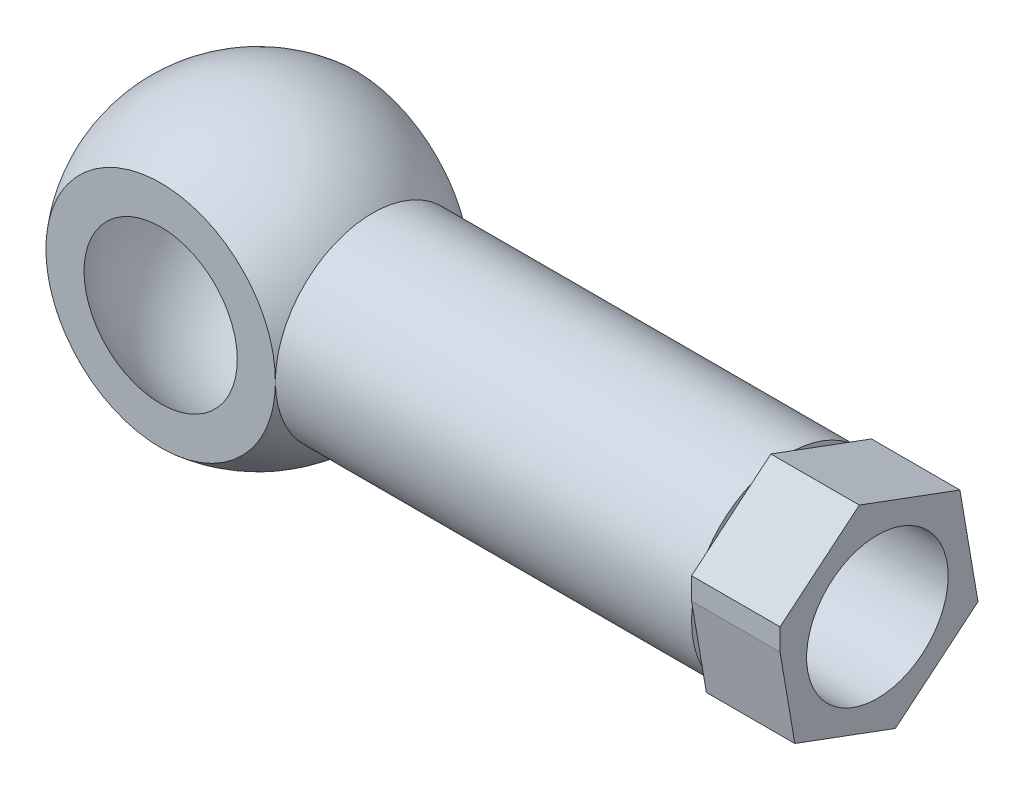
ISO-10303-21;
HEADER;
FILE_DESCRIPTION(('STEP AP214'),'2;1');
FILE_NAME('part.step','',(''),(''),'','','');
FILE_SCHEMA(('AUTOMOTIVE_DESIGN { 1 0 10303 214 1 1 1 1 }'));
ENDSEC;
DATA;
#1=APPLICATION_CONTEXT('core data for automotive mechanical design processes');
#2=APPLICATION_PROTOCOL_DEFINITION('international standard','automotive_design',2000,#1);
#3=PRODUCT_CONTEXT('',#1,'mechanical');
#4=PRODUCT('Part','Part','',(#3));
#5=PRODUCT_RELATED_PRODUCT_CATEGORY('part','',(#4));
#6=PRODUCT_DEFINITION_FORMATION('','',#4);
#7=PRODUCT_DEFINITION_CONTEXT('part definition',#1,'design');
#8=PRODUCT_DEFINITION('design','',#6,#7);
#9=PRODUCT_DEFINITION_SHAPE('','',#8);
#10=(LENGTH_UNIT() NAMED_UNIT(*) SI_UNIT(.MILLI.,.METRE.));
#11=(NAMED_UNIT(*) PLANE_ANGLE_UNIT() SI_UNIT($,.RADIAN.));
#12=(NAMED_UNIT(*) SI_UNIT($,.STERADIAN.) SOLID_ANGLE_UNIT());
#13=UNCERTAINTY_MEASURE_WITH_UNIT(LENGTH_MEASURE(1.E-05),#10,'distance_accuracy_value','');
#14=(GEOMETRIC_REPRESENTATION_CONTEXT(3) GLOBAL_UNCERTAINTY_ASSIGNED_CONTEXT((#13)) GLOBAL_UNIT_ASSIGNED_CONTEXT((#10,
#11,#12)) REPRESENTATION_CONTEXT('',''));
#15=CARTESIAN_POINT('',(0.,0.,0.));
#16=DIRECTION('',(0.,0.,1.));
#17=DIRECTION('',(1.,0.,0.));
#18=AXIS2_PLACEMENT_3D('',#15,#16,#17);
#19=CARTESIAN_POINT('',(34.077037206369,-152.96148139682,-11.));
#20=DIRECTION('',(0.,0.,1.));
#21=DIRECTION('',(1.,0.,0.));
#22=AXIS2_PLACEMENT_3D('',#19,#20,#21);
#23=PLANE('',#22);
#24=CARTESIAN_POINT('',(55.6732611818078,-139.335755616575,-11.));
#25=CARTESIAN_POINT('',(55.6546908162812,-139.094363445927,-11.));
#26=CARTESIAN_POINT('',(55.6259917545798,-138.85373742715,-11.));
#27=CARTESIAN_POINT('',(55.5485370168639,-138.3757423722,-11.));
#28=CARTESIAN_POINT('',(55.4997813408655,-138.138373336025,-11.));
#29=CARTESIAN_POINT('',(55.3825563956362,-137.668552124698,-11.));
#30=CARTESIAN_POINT('',(55.3140871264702,-137.43609994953,-11.));
#31=CARTESIAN_POINT('',(55.1579162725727,-136.977749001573,-11.));
#32=CARTESIAN_POINT('',(55.07021468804,-136.751850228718,-11.));
#33=CARTESIAN_POINT('',(54.876195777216,-136.308193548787,-11.0000000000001));
#34=CARTESIAN_POINT('',(54.7698784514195,-136.090435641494,-11.0000000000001));
#35=CARTESIAN_POINT('',(54.5393754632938,-135.66459169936,-11.0000000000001));
#36=CARTESIAN_POINT('',(54.41518979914,-135.456505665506,-11.0000000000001));
#37=CARTESIAN_POINT('',(54.1498231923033,-135.051468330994,-11.));
#38=CARTESIAN_POINT('',(54.0086422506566,-134.854517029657,-11.));
#39=CARTESIAN_POINT('',(53.7102776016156,-134.473133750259,-10.9999999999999));
#40=CARTESIAN_POINT('',(53.5530938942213,-134.288701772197,-10.9999999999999));
#41=CARTESIAN_POINT('',(53.2238287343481,-133.933653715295,-11.));
#42=CARTESIAN_POINT('',(53.0517472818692,-133.763037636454,-11.));
#43=CARTESIAN_POINT('',(52.6938963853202,-133.436820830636,-11.0000000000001));
#44=CARTESIAN_POINT('',(52.50812694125,-133.281220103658,-11.0000000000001));
#45=CARTESIAN_POINT('',(52.1242060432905,-132.986127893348,-11.));
#46=CARTESIAN_POINT('',(51.9260545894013,-132.846636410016,-11.));
#47=CARTESIAN_POINT('',(51.5187627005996,-132.584743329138,-11.));
#48=CARTESIAN_POINT('',(51.309622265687,-132.462341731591,-11.));
#49=CARTESIAN_POINT('',(50.8818226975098,-132.235488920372,-11.));
#50=CARTESIAN_POINT('',(50.6631635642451,-132.131037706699,-11.));
#51=CARTESIAN_POINT('',(50.2178637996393,-131.940819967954,-11.));
#52=CARTESIAN_POINT('',(49.9912231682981,-131.855053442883,-11.));
#53=CARTESIAN_POINT('',(49.5315537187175,-131.702808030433,-11.));
#54=CARTESIAN_POINT('',(49.298524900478,-131.636329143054,-11.));
#55=CARTESIAN_POINT('',(48.8277172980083,-131.523126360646,-11.));
#56=CARTESIAN_POINT('',(48.5899385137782,-131.476402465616,-11.));
#57=CARTESIAN_POINT('',(48.1113025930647,-131.403038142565,-11.));
#58=CARTESIAN_POINT('',(47.8704454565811,-131.376397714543,-11.));
#59=CARTESIAN_POINT('',(47.3873460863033,-131.343387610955,-11.));
#60=CARTESIAN_POINT('',(47.145103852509,-131.337017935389,-11.));
#61=CARTESIAN_POINT('',(46.6609372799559,-131.344594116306,-11.));
#62=CARTESIAN_POINT('',(46.4190129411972,-131.358539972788,-11.));
#63=CARTESIAN_POINT('',(45.9371829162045,-131.406649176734,-11.));
#64=CARTESIAN_POINT('',(45.6972772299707,-131.440812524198,-11.));
#65=CARTESIAN_POINT('',(45.2211710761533,-131.529116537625,-11.));
#66=CARTESIAN_POINT('',(44.9849706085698,-131.583257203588,-11.));
#67=CARTESIAN_POINT('',(44.5179354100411,-131.711135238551,-11.));
#68=CARTESIAN_POINT('',(44.2871006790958,-131.784872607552,-11.));
#69=CARTESIAN_POINT('',(43.8324197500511,-131.951425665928,-11.));
#70=CARTESIAN_POINT('',(43.6085735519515,-132.044241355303,-11.));
#71=CARTESIAN_POINT('',(43.1694433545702,-132.248298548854,-11.));
#72=CARTESIAN_POINT('',(42.9541593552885,-132.359540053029,-11.0000000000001));
#73=CARTESIAN_POINT('',(42.533667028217,-132.599666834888,-11.));
#74=CARTESIAN_POINT('',(42.3284587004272,-132.728552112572,-11.));
#75=CARTESIAN_POINT('',(41.9295603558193,-133.003060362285,-11.));
#76=CARTESIAN_POINT('',(41.7358703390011,-133.148683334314,-11.));
#77=CARTESIAN_POINT('',(41.3613702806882,-133.455643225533,-11.));
#78=CARTESIAN_POINT('',(41.1805602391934,-133.616980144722,-11.));
#79=CARTESIAN_POINT('',(40.8330912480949,-133.954233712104,-11.));
#80=CARTESIAN_POINT('',(40.6664322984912,-134.130150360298,-11.));
#81=CARTESIAN_POINT('',(40.3484371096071,-134.495326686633,-11.));
#82=CARTESIAN_POINT('',(40.1971008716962,-134.684586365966,-10.9999999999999));
#83=CARTESIAN_POINT('',(39.9108150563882,-135.075118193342,-11.));
#84=CARTESIAN_POINT('',(39.7758654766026,-135.276390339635,-11.));
#85=CARTESIAN_POINT('',(39.5233016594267,-135.689532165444,-11.));
#86=CARTESIAN_POINT('',(39.4056874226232,-135.90140184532,-11.));
#87=CARTESIAN_POINT('',(39.1886211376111,-136.334249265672,-11.));
#88=CARTESIAN_POINT('',(39.0891690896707,-136.555227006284,-11.));
#89=CARTESIAN_POINT('',(38.9091263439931,-137.004737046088,-11.0000000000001));
#90=CARTESIAN_POINT('',(38.8285356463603,-137.233269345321,-11.));
#91=CARTESIAN_POINT('',(38.6867821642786,-137.696281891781,-11.));
#92=CARTESIAN_POINT('',(38.6256193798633,-137.930762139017,-11.));
#93=CARTESIAN_POINT('',(38.5231517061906,-138.404022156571,-11.));
#94=CARTESIAN_POINT('',(38.4818468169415,-138.642801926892,-11.0000000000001));
#95=CARTESIAN_POINT('',(38.4193853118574,-139.122982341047,-11.0000000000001));
#96=CARTESIAN_POINT('',(38.3982286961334,-139.364382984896,-11.));
#97=CARTESIAN_POINT('',(38.3762124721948,-139.848108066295,-11.));
#98=CARTESIAN_POINT('',(38.375352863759,-140.090432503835,-11.));
#99=CARTESIAN_POINT('',(38.3939366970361,-140.574301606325,-11.));
#100=CARTESIAN_POINT('',(38.4133801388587,-140.81584627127,-11.0000000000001));
#101=CARTESIAN_POINT('',(38.4724333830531,-141.296457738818,-11.0000000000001));
#102=CARTESIAN_POINT('',(38.5120431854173,-141.535524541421,-11.));
#103=CARTESIAN_POINT('',(38.611150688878,-142.009499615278,-11.));
#104=CARTESIAN_POINT('',(38.6706483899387,-142.244407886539,-11.));
#105=CARTESIAN_POINT('',(38.8091134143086,-142.708414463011,-11.));
#106=CARTESIAN_POINT('',(38.8880807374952,-142.937512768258,-11.));
#107=CARTESIAN_POINT('',(39.0649298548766,-143.388288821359,-11.));
#108=CARTESIAN_POINT('',(39.1628116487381,-143.609966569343,-11.));
#109=CARTESIAN_POINT('',(39.3768015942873,-144.04434310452,-11.));
#110=CARTESIAN_POINT('',(39.4929097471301,-144.257041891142,-11.));
#111=CARTESIAN_POINT('',(39.7425361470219,-144.671965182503,-11.));
#112=CARTESIAN_POINT('',(39.8760543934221,-144.874189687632,-11.));
#113=CARTESIAN_POINT('',(40.1595623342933,-145.266742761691,-11.));
#114=CARTESIAN_POINT('',(40.3095520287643,-145.45707133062,-11.));
#115=CARTESIAN_POINT('',(40.6249484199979,-145.824494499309,-11.));
#116=CARTESIAN_POINT('',(40.7903551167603,-146.001589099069,-11.));
#117=CARTESIAN_POINT('',(41.1354226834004,-146.341299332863,-11.));
#118=CARTESIAN_POINT('',(41.3150835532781,-146.503914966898,-11.));
#119=CARTESIAN_POINT('',(41.6873964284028,-146.813524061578,-11.));
#120=CARTESIAN_POINT('',(41.8800484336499,-146.960517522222,-11.));
#121=CARTESIAN_POINT('',(42.2769892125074,-147.237848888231,-11.));
#122=CARTESIAN_POINT('',(42.4812779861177,-147.368186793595,-11.));
#123=CARTESIAN_POINT('',(42.9000561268,-147.61129075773,-11.));
#124=CARTESIAN_POINT('',(43.114545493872,-147.724056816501,-11.));
#125=CARTESIAN_POINT('',(43.5522169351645,-147.931224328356,-11.));
#126=CARTESIAN_POINT('',(43.7753990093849,-148.025625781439,-11.));
#127=CARTESIAN_POINT('',(44.2288868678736,-148.195400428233,-11.));
#128=CARTESIAN_POINT('',(44.4591926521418,-148.270773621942,-11.));
#129=CARTESIAN_POINT('',(44.9253088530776,-148.401961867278,-11.));
#130=CARTESIAN_POINT('',(45.1611192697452,-148.457776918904,-11.));
#131=CARTESIAN_POINT('',(45.6365869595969,-148.549456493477,-11.));
#132=CARTESIAN_POINT('',(45.8762442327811,-148.585321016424,-11.));
#133=CARTESIAN_POINT('',(46.3577208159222,-148.636847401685,-11.));
#134=CARTESIAN_POINT('',(46.5995401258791,-148.652509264,-11.));
#135=CARTESIAN_POINT('',(47.0836407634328,-148.6635202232,-11.));
#136=CARTESIAN_POINT('',(47.3259220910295,-148.658869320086,-11.));
#137=CARTESIAN_POINT('',(47.809243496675,-148.629287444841,-11.));
#138=CARTESIAN_POINT('',(48.0502835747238,-148.604356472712,-11.));
#139=CARTESIAN_POINT('',(48.5294279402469,-148.534389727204,-11.));
#140=CARTESIAN_POINT('',(48.7675322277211,-148.489353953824,-11.));
#141=CARTESIAN_POINT('',(49.2391311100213,-148.379494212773,-11.));
#142=CARTESIAN_POINT('',(49.4726257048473,-148.314670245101,-11.));
#143=CARTESIAN_POINT('',(49.9333637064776,-148.165689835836,-11.));
#144=CARTESIAN_POINT('',(50.1606071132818,-148.081533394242,-11.));
#145=CARTESIAN_POINT('',(50.6072451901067,-147.894479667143,-11.));
#146=CARTESIAN_POINT('',(50.8266398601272,-147.791582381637,-11.));
#147=CARTESIAN_POINT('',(51.2560380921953,-147.567770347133,-11.));
#148=CARTESIAN_POINT('',(51.4660416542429,-147.446855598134,-11.));
#149=CARTESIAN_POINT('',(51.8751813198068,-147.187858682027,-11.));
#150=CARTESIAN_POINT('',(52.0743174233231,-147.049776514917,-11.));
#151=CARTESIAN_POINT('',(52.460322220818,-146.757415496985,-11.));
#152=CARTESIAN_POINT('',(52.6471909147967,-146.603136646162,-11.));
#153=CARTESIAN_POINT('',(53.0073471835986,-146.27946685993,-11.));
#154=CARTESIAN_POINT('',(53.1806347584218,-146.110075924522,-11.));
#155=CARTESIAN_POINT('',(53.5124105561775,-145.75737280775,-11.));
#156=CARTESIAN_POINT('',(53.6708987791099,-145.574060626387,-11.));
#157=CARTESIAN_POINT('',(53.9719616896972,-145.194803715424,-11.));
#158=CARTESIAN_POINT('',(54.1145363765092,-144.998858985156,-11.));
#159=CARTESIAN_POINT('',(54.3827698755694,-144.595714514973,-11.));
#160=CARTESIAN_POINT('',(54.5084286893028,-144.388514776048,-11.));
#161=CARTESIAN_POINT('',(54.7419470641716,-143.964316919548,-11.));
#162=CARTESIAN_POINT('',(54.8498066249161,-143.747318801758,-11.));
#163=CARTESIAN_POINT('',(55.0469682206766,-143.305049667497,-11.));
#164=CARTESIAN_POINT('',(55.1362702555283,-143.079778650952,-11.));
#165=CARTESIAN_POINT('',(55.2956890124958,-142.622547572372,-11.));
#166=CARTESIAN_POINT('',(55.3658057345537,-142.390587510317,-11.));
#167=CARTESIAN_POINT('',(55.4863608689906,-141.921608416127,-11.));
#168=CARTESIAN_POINT('',(55.5367992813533,-141.684589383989,-11.));
#169=CARTESIAN_POINT('',(55.6176434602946,-141.207160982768,-11.));
#170=CARTESIAN_POINT('',(55.6480492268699,-140.966751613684,-11.));
#171=CARTESIAN_POINT('',(55.6886134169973,-140.484223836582,-11.));
#172=CARTESIAN_POINT('',(55.6987718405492,-140.242105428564,-11.));
#173=CARTESIAN_POINT('',(55.6987733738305,-139.77836392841,-11.));
#174=CARTESIAN_POINT('',(55.6902614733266,-139.556738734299,-11.));
#175=CARTESIAN_POINT('',(55.6732611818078,-139.335755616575,-11.));
#176=B_SPLINE_CURVE_WITH_KNOTS('',3,(#24,#25,#26,#27,#28,#29,#30,#31,#32,#33,#34,#35,#36,#37,
#38,#39,#40,#41,#42,#43,#44,#45,#46,#47,#48,#49,#50,#51,#52,#53,#54,#55,#56,#57,#58,#59,#60,#61,
#62,#63,#64,#65,#66,#67,#68,#69,#70,#71,#72,#73,#74,#75,#76,#77,#78,#79,#80,#81,#82,#83,#84,#85,
#86,#87,#88,#89,#90,#91,#92,#93,#94,#95,#96,#97,#98,#99,#100,#101,#102,#103,#104,#105,#106,#107,
#108,#109,#110,#111,#112,#113,#114,#115,#116,#117,#118,#119,#120,#121,#122,#123,#124,#125,#126,
#127,#128,#129,#130,#131,#132,#133,#134,#135,#136,#137,#138,#139,#140,#141,#142,#143,#144,#145,
#146,#147,#148,#149,#150,#151,#152,#153,#154,#155,#156,#157,#158,#159,#160,#161,#162,#163,#164,
#165,#166,#167,#168,#169,#170,#171,#172,#173,#174,#175),.UNSPECIFIED.,.T.,.F.,(4,2,2,2,2,2,2,2,
2,2,2,2,2,2,2,2,2,2,2,2,2,2,2,2,2,2,2,2,2,2,2,2,2,2,2,2,2,2,2,2,2,2,2,2,2,2,2,2,2,2,2,2,2,2,2,2,
2,2,2,2,2,2,2,2,2,2,2,2,2,2,2,2,2,2,2,4),(0.,0.726126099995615,1.45225219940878,
2.17837829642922,2.90450438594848,3.63063045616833,4.35675660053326,5.08288270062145,
5.80900880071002,6.53513490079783,7.26126100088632,7.98738710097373,8.71351320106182,
9.43963930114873,10.165765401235,10.8918915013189,11.6180176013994,12.3441437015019,
13.0702698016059,13.7963959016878,14.5225220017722,15.2486481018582,15.9747742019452,
16.7009003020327,17.427026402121,18.1531525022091,18.8792786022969,19.6054047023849,
20.3315308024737,21.0576569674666,21.7837830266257,22.5099091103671,23.2360352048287,
23.9621613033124,24.6882874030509,25.4144135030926,26.1405396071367,26.8666657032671,
27.5927918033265,28.3189179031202,29.0450440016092,29.7711700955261,30.49729617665,
31.2234223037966,31.9495484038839,32.6756745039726,33.4018006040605,34.1279267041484,
34.8540528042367,35.5801789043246,36.3063050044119,37.0324311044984,37.7585572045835,
38.4846833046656,39.2108094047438,39.93693550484,40.6630616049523,41.3891877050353,
42.1153138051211,42.8414399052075,43.5675660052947,44.2936921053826,45.019818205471,
45.7459443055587,46.4720704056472,47.1981965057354,47.9243226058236,48.6504487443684,
49.3765748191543,50.1027009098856,50.828827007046,51.5549531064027,52.2810792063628,
53.0072053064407,53.7333314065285,54.3980655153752),.UNSPECIFIED.);
#177=CARTESIAN_POINT('',(55.6732611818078,-139.335755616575,-11.));
#178=VERTEX_POINT('',#177);
#179=EDGE_CURVE('E256',#178,#178,#176,.T.);
#180=ORIENTED_EDGE('',*,*,#179,.T.);
#181=EDGE_LOOP('',(#180));
#182=FACE_BOUND('',#181,.T.);
#183=CARTESIAN_POINT('',(59.9999999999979,-140.,-11.0000000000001));
#184=CARTESIAN_POINT('',(60.0000004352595,-139.758878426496,-11.));
#185=CARTESIAN_POINT('',(59.9932706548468,-139.517765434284,-10.9999999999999));
#186=CARTESIAN_POINT('',(59.9646613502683,-139.005677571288,-10.9999999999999));
#187=CARTESIAN_POINT('',(59.9409651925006,-138.734801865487,-11.0000000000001));
#188=CARTESIAN_POINT('',(59.8765922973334,-138.195081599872,-11.0000000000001));
#189=CARTESIAN_POINT('',(59.8359155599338,-137.926237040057,-11.));
#190=CARTESIAN_POINT('',(59.7377425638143,-137.391635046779,-10.9999999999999));
#191=CARTESIAN_POINT('',(59.6802463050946,-137.125877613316,-11.));
#192=CARTESIAN_POINT('',(59.548661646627,-136.598503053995,-11.));
#193=CARTESIAN_POINT('',(59.4745732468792,-136.336885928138,-11.));
#194=CARTESIAN_POINT('',(59.310097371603,-135.818826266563,-11.));
#195=CARTESIAN_POINT('',(59.2197098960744,-135.562383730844,-11.));
#196=CARTESIAN_POINT('',(59.0229933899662,-135.055687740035,-11.));
#197=CARTESIAN_POINT('',(58.9166643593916,-134.805434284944,-11.0000000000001));
#198=CARTESIAN_POINT('',(58.6884853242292,-134.312106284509,-11.0000000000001));
#199=CARTESIAN_POINT('',(58.566635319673,-134.069031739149,-11.0000000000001));
#200=CARTESIAN_POINT('',(58.3078963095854,-133.591023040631,-11.));
#201=CARTESIAN_POINT('',(58.171007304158,-133.356088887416,-11.));
#202=CARTESIAN_POINT('',(57.8827317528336,-132.89529024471,-11.));
#203=CARTESIAN_POINT('',(57.7313452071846,-132.669425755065,-11.));
#204=CARTESIAN_POINT('',(57.4146733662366,-132.227659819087,-10.9999999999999));
#205=CARTESIAN_POINT('',(57.2493880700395,-132.011758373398,-10.9999999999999));
#206=CARTESIAN_POINT('',(56.9055725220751,-131.590772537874,-10.9999999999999));
#207=CARTESIAN_POINT('',(56.7270422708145,-131.385688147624,-11.0000000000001));
#208=CARTESIAN_POINT('',(56.3574429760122,-130.987147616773,-11.0000000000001));
#209=CARTESIAN_POINT('',(56.1663739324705,-130.793691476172,-11.));
#210=CARTESIAN_POINT('',(55.7724528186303,-130.419172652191,-11.));
#211=CARTESIAN_POINT('',(55.5696007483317,-130.238109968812,-11.0000000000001));
#212=CARTESIAN_POINT('',(55.1529159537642,-129.889094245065,-11.0000000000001));
#213=CARTESIAN_POINT('',(54.9390832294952,-129.721141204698,-11.));
#214=CARTESIAN_POINT('',(54.5012829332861,-129.399009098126,-11.));
#215=CARTESIAN_POINT('',(54.277315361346,-129.24483003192,-11.));
#216=CARTESIAN_POINT('',(53.820131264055,-128.950855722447,-11.));
#217=CARTESIAN_POINT('',(53.5869147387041,-128.81106047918,-11.));
#218=CARTESIAN_POINT('',(53.1121552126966,-128.546406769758,-11.));
#219=CARTESIAN_POINT('',(52.87061221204,-128.421548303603,-11.));
#220=CARTESIAN_POINT('',(52.3801551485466,-128.187262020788,-11.));
#221=CARTESIAN_POINT('',(52.1312410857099,-128.077834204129,-11.));
#222=CARTESIAN_POINT('',(51.6270264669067,-127.874842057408,-11.));
#223=CARTESIAN_POINT('',(51.3717259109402,-127.781277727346,-11.0000000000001));
#224=CARTESIAN_POINT('',(50.8557481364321,-127.61038264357,-11.));
#225=CARTESIAN_POINT('',(50.5950709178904,-127.533051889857,-11.));
#226=CARTESIAN_POINT('',(50.0693709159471,-127.394929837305,-10.9999999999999));
#227=CARTESIAN_POINT('',(49.8043481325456,-127.334138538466,-11.));
#228=CARTESIAN_POINT('',(49.2710052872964,-127.229335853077,-11.));
#229=CARTESIAN_POINT('',(49.0026852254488,-127.185324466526,-11.));
#230=CARTESIAN_POINT('',(48.4638091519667,-127.114255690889,-11.));
#231=CARTESIAN_POINT('',(48.1932531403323,-127.087198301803,-10.9999999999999));
#232=CARTESIAN_POINT('',(47.6509753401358,-127.050144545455,-11.));
#233=CARTESIAN_POINT('',(47.3792535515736,-127.040148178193,-11.));
#234=CARTESIAN_POINT('',(46.835718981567,-127.037256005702,-11.));
#235=CARTESIAN_POINT('',(46.5639062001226,-127.044360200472,-11.));
#236=CARTESIAN_POINT('',(46.0212647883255,-127.075641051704,-10.9999999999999));
#237=CARTESIAN_POINT('',(45.7504361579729,-127.099817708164,-10.9999999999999));
#238=CARTESIAN_POINT('',(45.210834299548,-127.165147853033,-10.9999999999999));
#239=CARTESIAN_POINT('',(44.9420610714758,-127.206301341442,-11.));
#240=CARTESIAN_POINT('',(44.4076331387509,-127.305422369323,-11.));
#241=CARTESIAN_POINT('',(44.1419784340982,-127.363389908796,-11.0000000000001));
#242=CARTESIAN_POINT('',(43.6148383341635,-127.495909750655,-11.0000000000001));
#243=CARTESIAN_POINT('',(43.3533529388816,-127.570462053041,-11.));
#244=CARTESIAN_POINT('',(42.8355857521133,-127.735856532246,-10.9999999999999));
#245=CARTESIAN_POINT('',(42.5793039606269,-127.826698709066,-11.));
#246=CARTESIAN_POINT('',(42.0729576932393,-128.024313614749,-11.));
#247=CARTESIAN_POINT('',(41.822893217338,-128.131086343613,-11.));
#248=CARTESIAN_POINT('',(41.3299707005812,-128.36014001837,-11.));
#249=CARTESIAN_POINT('',(41.0871126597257,-128.482420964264,-10.9999999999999));
#250=CARTESIAN_POINT('',(40.6095636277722,-128.74200739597,-11.));
#251=CARTESIAN_POINT('',(40.3748726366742,-128.879312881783,-11.));
#252=CARTESIAN_POINT('',(39.9145860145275,-129.168405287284,-11.0000000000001));
#253=CARTESIAN_POINT('',(39.6889903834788,-129.320192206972,-11.));
#254=CARTESIAN_POINT('',(39.2477868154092,-129.637647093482,-11.));
#255=CARTESIAN_POINT('',(39.0321788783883,-129.803315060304,-11.));
#256=CARTESIAN_POINT('',(38.6118035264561,-130.14787674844,-11.));
#257=CARTESIAN_POINT('',(38.4070361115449,-130.326770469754,-11.));
#258=CARTESIAN_POINT('',(38.0091517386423,-130.697076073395,-11.));
#259=CARTESIAN_POINT('',(37.8160347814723,-130.888487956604,-10.9999999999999));
#260=CARTESIAN_POINT('',(37.4422152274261,-131.283072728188,-10.9999999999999));
#261=CARTESIAN_POINT('',(37.2615126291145,-131.486245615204,-11.));
#262=CARTESIAN_POINT('',(36.913236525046,-131.903548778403,-11.));
#263=CARTESIAN_POINT('',(36.7456630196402,-132.11767905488,-10.9999999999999));
#264=CARTESIAN_POINT('',(36.4243079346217,-132.556050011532,-10.9999999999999));
#265=CARTESIAN_POINT('',(36.2705263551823,-132.780290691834,-11.));
#266=CARTESIAN_POINT('',(35.9773634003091,-133.237995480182,-11.));
#267=CARTESIAN_POINT('',(35.837982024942,-133.47145958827,-11.));
#268=CARTESIAN_POINT('',(35.5741707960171,-133.94668777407,-11.));
#269=CARTESIAN_POINT('',(35.4497409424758,-134.18845185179,-11.));
#270=CARTESIAN_POINT('',(35.2163249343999,-134.679323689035,-11.));
#271=CARTESIAN_POINT('',(35.1073387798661,-134.92843144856,-11.));
#272=CARTESIAN_POINT('',(34.9052412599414,-135.433005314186,-11.));
#273=CARTESIAN_POINT('',(34.81212989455,-135.688471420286,-11.));
#274=CARTESIAN_POINT('',(34.6421502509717,-136.204751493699,-11.));
#275=CARTESIAN_POINT('',(34.5652819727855,-136.465565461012,-11.));
#276=CARTESIAN_POINT('',(34.428092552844,-136.991509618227,-11.));
#277=CARTESIAN_POINT('',(34.3677714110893,-137.25663980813,-11.));
#278=CARTESIAN_POINT('',(34.2639148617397,-137.79016769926,-11.));
#279=CARTESIAN_POINT('',(34.2203794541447,-138.058565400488,-11.));
#280=CARTESIAN_POINT('',(34.150266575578,-138.59756667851,-10.9999999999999));
#281=CARTESIAN_POINT('',(34.1236891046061,-138.868170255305,-10.9999999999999));
#282=CARTESIAN_POINT('',(34.0875972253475,-139.410512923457,-11.));
#283=CARTESIAN_POINT('',(34.0780828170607,-139.682252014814,-11.));
#284=CARTESIAN_POINT('',(34.0761546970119,-140.225790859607,-11.));
#285=CARTESIAN_POINT('',(34.0837409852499,-140.497590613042,-11.));
#286=CARTESIAN_POINT('',(34.1159842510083,-141.040175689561,-11.));
#287=CARTESIAN_POINT('',(34.1406412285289,-141.310961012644,-11.));
#288=CARTESIAN_POINT('',(34.2069283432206,-141.850446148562,-11.));
#289=CARTESIAN_POINT('',(34.2485584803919,-142.119145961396,-11.));
#290=CARTESIAN_POINT('',(34.348627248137,-142.653397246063,-11.));
#291=CARTESIAN_POINT('',(34.4070658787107,-142.918948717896,-10.9999999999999));
#292=CARTESIAN_POINT('',(34.5405204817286,-143.445852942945,-10.9999999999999));
#293=CARTESIAN_POINT('',(34.6155364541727,-143.707205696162,-11.));
#294=CARTESIAN_POINT('',(34.781849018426,-144.224678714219,-11.));
#295=CARTESIAN_POINT('',(34.8731456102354,-144.48079897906,-11.));
#296=CARTESIAN_POINT('',(35.0716582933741,-144.986793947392,-11.));
#297=CARTESIAN_POINT('',(35.1788743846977,-145.236668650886,-11.));
#298=CARTESIAN_POINT('',(35.408801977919,-145.729184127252,-11.));
#299=CARTESIAN_POINT('',(35.5315134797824,-145.97182490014,-11.));
#300=CARTESIAN_POINT('',(35.7919465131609,-146.44891275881,-11.));
#301=CARTESIAN_POINT('',(35.9296680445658,-146.683359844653,-11.));
#302=CARTESIAN_POINT('',(36.2195763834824,-147.143132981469,-11.));
#303=CARTESIAN_POINT('',(36.3717631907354,-147.368459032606,-11.));
#304=CARTESIAN_POINT('',(36.6900001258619,-147.809098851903,-11.));
#305=CARTESIAN_POINT('',(36.8560502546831,-148.024412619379,-11.));
#306=CARTESIAN_POINT('',(37.2013570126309,-148.444176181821,-11.));
#307=CARTESIAN_POINT('',(37.3806136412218,-148.648625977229,-11.));
#308=CARTESIAN_POINT('',(37.7516243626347,-149.04585291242,-11.));
#309=CARTESIAN_POINT('',(37.9433784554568,-149.238630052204,-11.));
#310=CARTESIAN_POINT('',(38.3386256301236,-149.61174915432,-11.));
#311=CARTESIAN_POINT('',(38.5421187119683,-149.792091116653,-11.));
#312=CARTESIAN_POINT('',(38.9600389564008,-150.139626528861,-11.));
#313=CARTESIAN_POINT('',(39.1744661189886,-150.306819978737,-11.));
#314=CARTESIAN_POINT('',(39.6134063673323,-150.627397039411,-11.));
#315=CARTESIAN_POINT('',(39.8379194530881,-150.780780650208,-11.));
#316=CARTESIAN_POINT('',(40.2961434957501,-151.073131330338,-11.));
#317=CARTESIAN_POINT('',(40.5298544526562,-151.212098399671,-11.));
#318=CARTESIAN_POINT('',(41.0055498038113,-151.475066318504,-11.));
#319=CARTESIAN_POINT('',(41.2475341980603,-151.599067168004,-11.));
#320=CARTESIAN_POINT('',(41.7388192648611,-151.831612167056,-11.));
#321=CARTESIAN_POINT('',(41.9881199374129,-151.940156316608,-11.));
#322=CARTESIAN_POINT('',(42.4930514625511,-152.141358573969,-11.));
#323=CARTESIAN_POINT('',(42.7486823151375,-152.234016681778,-11.));
#324=CARTESIAN_POINT('',(43.2652630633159,-152.403080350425,-11.));
#325=CARTESIAN_POINT('',(43.5262129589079,-152.479485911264,-11.));
#326=CARTESIAN_POINT('',(44.0523996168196,-152.615742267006,-11.));
#327=CARTESIAN_POINT('',(44.3176363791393,-152.675593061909,-11.));
#328=CARTESIAN_POINT('',(44.851347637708,-152.778503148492,-11.));
#329=CARTESIAN_POINT('',(45.119822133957,-152.821562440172,-11.));
#330=CARTESIAN_POINT('',(45.6589469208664,-152.8907192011,-11.));
#331=CARTESIAN_POINT('',(45.9295972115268,-152.916816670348,-11.));
#332=CARTESIAN_POINT('',(46.472003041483,-152.951946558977,-11.));
#333=CARTESIAN_POINT('',(46.7437585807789,-152.960978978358,-11.));
#334=CARTESIAN_POINT('',(47.2872999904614,-152.961943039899,-11.));
#335=CARTESIAN_POINT('',(47.559085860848,-152.953874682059,-11.));
#336=CARTESIAN_POINT('',(48.101612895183,-152.920669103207,-11.));
#337=CARTESIAN_POINT('',(48.3723540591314,-152.895531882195,-11.));
#338=CARTESIAN_POINT('',(48.9117207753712,-152.828288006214,-11.));
#339=CARTESIAN_POINT('',(49.1803463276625,-152.786181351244,-11.));
#340=CARTESIAN_POINT('',(49.7144192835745,-152.685165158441,-11.));
#341=CARTESIAN_POINT('',(49.9798666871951,-152.626255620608,-11.));
#342=CARTESIAN_POINT('',(50.5065333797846,-152.491866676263,-11.));
#343=CARTESIAN_POINT('',(50.7677526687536,-152.416387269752,-11.));
#344=CARTESIAN_POINT('',(51.2849298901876,-152.249157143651,-11.));
#345=CARTESIAN_POINT('',(51.5408878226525,-152.157406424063,-11.));
#346=CARTESIAN_POINT('',(52.0465299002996,-151.9579965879,-11.));
#347=CARTESIAN_POINT('',(52.2962140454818,-151.850337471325,-11.));
#348=CARTESIAN_POINT('',(52.7883209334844,-151.619536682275,-11.));
#349=CARTESIAN_POINT('',(53.0307436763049,-151.496395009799,-11.));
#350=CARTESIAN_POINT('',(53.5073688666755,-151.235116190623,-11.));
#351=CARTESIAN_POINT('',(53.7415713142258,-151.096979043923,-11.));
#352=CARTESIAN_POINT('',(54.2008295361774,-150.806255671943,-11.));
#353=CARTESIAN_POINT('',(54.4258853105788,-150.653669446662,-11.));
#354=CARTESIAN_POINT('',(54.8659599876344,-150.334651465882,-11.));
#355=CARTESIAN_POINT('',(55.0809788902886,-150.168219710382,-11.));
#356=CARTESIAN_POINT('',(55.5001293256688,-149.822168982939,-11.));
#357=CARTESIAN_POINT('',(55.7042608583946,-149.642550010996,-11.));
#358=CARTESIAN_POINT('',(56.1008291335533,-149.270835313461,-11.));
#359=CARTESIAN_POINT('',(56.2932658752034,-149.078739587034,-11.));
#360=CARTESIAN_POINT('',(56.6656833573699,-148.682831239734,-11.));
#361=CARTESIAN_POINT('',(56.8456640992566,-148.47901862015,-11.));
#362=CARTESIAN_POINT('',(57.1924577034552,-148.060482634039,-11.));
#363=CARTESIAN_POINT('',(57.3592705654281,-147.845759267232,-11.));
#364=CARTESIAN_POINT('',(57.6790685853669,-147.406251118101,-11.));
#365=CARTESIAN_POINT('',(57.8320537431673,-147.181466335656,-11.));
#366=CARTESIAN_POINT('',(58.1235912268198,-146.722724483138,-11.));
#367=CARTESIAN_POINT('',(58.2621435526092,-146.488767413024,-11.));
#368=CARTESIAN_POINT('',(58.5242673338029,-146.012606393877,-11.));
#369=CARTESIAN_POINT('',(58.6478387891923,-145.770402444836,-11.));
#370=CARTESIAN_POINT('',(58.8795120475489,-145.278705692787,-11.));
#371=CARTESIAN_POINT('',(58.9876138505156,-145.02921288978,-11.));
#372=CARTESIAN_POINT('',(59.1879202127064,-144.523925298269,-11.));
#373=CARTESIAN_POINT('',(59.2801247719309,-144.268130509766,-11.));
#374=CARTESIAN_POINT('',(59.4482719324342,-143.75125069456,-11.));
#375=CARTESIAN_POINT('',(59.5242145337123,-143.490165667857,-11.));
#376=CARTESIAN_POINT('',(59.6595374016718,-142.963738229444,-11.));
#377=CARTESIAN_POINT('',(59.7189176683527,-142.698395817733,-11.));
#378=CARTESIAN_POINT('',(59.8208809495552,-142.164502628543,-11.));
#379=CARTESIAN_POINT('',(59.8634639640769,-141.895951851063,-11.0000000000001));
#380=CARTESIAN_POINT('',(59.9316644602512,-141.356706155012,-11.0000000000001));
#381=CARTESIAN_POINT('',(59.957281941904,-141.086011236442,-11.));
#382=CARTESIAN_POINT('',(59.9914494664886,-140.543540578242,-11.));
#383=CARTESIAN_POINT('',(59.9999995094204,-140.271764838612,-11.0000000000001));
#384=CARTESIAN_POINT('',(59.9999999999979,-140.,-11.0000000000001));
#385=B_SPLINE_CURVE_WITH_KNOTS('',3,(#183,#184,#185,#186,#187,#188,#189,#190,#191,#192,#193,
#194,#195,#196,#197,#198,#199,#200,#201,#202,#203,#204,#205,#206,#207,#208,#209,#210,#211,#212,
#213,#214,#215,#216,#217,#218,#219,#220,#221,#222,#223,#224,#225,#226,#227,#228,#229,#230,#231,
#232,#233,#234,#235,#236,#237,#238,#239,#240,#241,#242,#243,#244,#245,#246,#247,#248,#249,#250,
#251,#252,#253,#254,#255,#256,#257,#258,#259,#260,#261,#262,#263,#264,#265,#266,#267,#268,#269,
#270,#271,#272,#273,#274,#275,#276,#277,#278,#279,#280,#281,#282,#283,#284,#285,#286,#287,#288,
#289,#290,#291,#292,#293,#294,#295,#296,#297,#298,#299,#300,#301,#302,#303,#304,#305,#306,#307,
#308,#309,#310,#311,#312,#313,#314,#315,#316,#317,#318,#319,#320,#321,#322,#323,#324,#325,#326,
#327,#328,#329,#330,#331,#332,#333,#334,#335,#336,#337,#338,#339,#340,#341,#342,#343,#344,#345,
#346,#347,#348,#349,#350,#351,#352,#353,#354,#355,#356,#357,#358,#359,#360,#361,#362,#363,#364,
#365,#366,#367,#368,#369,#370,#371,#372,#373,#374,#375,#376,#377,#378,#379,#380,#381,#382,#383,
#384),.UNSPECIFIED.,.T.,.F.,(4,2,2,2,2,2,2,2,2,2,2,2,2,2,2,2,2,2,2,2,2,2,2,2,2,2,2,2,2,2,2,2,2,
2,2,2,2,2,2,2,2,2,2,2,2,2,2,2,2,2,2,2,2,2,2,2,2,2,2,2,2,2,2,2,2,2,2,2,2,2,2,2,2,2,2,2,2,2,2,2,2,
2,2,2,2,2,2,2,2,2,2,2,2,2,2,2,2,2,2,2,4),(0.,0.723262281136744,1.53844133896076,
2.35362039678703,3.16879945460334,3.98397851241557,4.79915757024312,5.61433662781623,
6.42951568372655,7.24469473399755,8.05987377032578,8.87505285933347,9.69023191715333,
10.5054109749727,11.3205900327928,12.1357690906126,12.950948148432,13.7661272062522,
14.5813062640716,15.3964853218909,16.2116643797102,17.0268434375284,17.8420224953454,
18.6572015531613,19.4723806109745,20.2875596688,21.1027387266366,21.9179177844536,
22.7330968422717,23.5482759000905,24.3634549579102,25.1786340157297,25.9938130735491,
26.808992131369,27.6241711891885,28.439350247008,29.2545293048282,30.0697083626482,
30.8848874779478,31.7000664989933,32.5152455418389,33.3304245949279,34.1456036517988,
34.9607827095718,35.7759617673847,36.5911408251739,37.4063198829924,38.2214989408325,
39.0366779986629,39.8518570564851,40.6670361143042,41.4822151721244,42.2973942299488,
43.1125732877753,43.9277523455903,44.7429314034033,45.5581104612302,46.3732895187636,
47.188468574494,48.0036476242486,48.8188266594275,49.6340057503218,50.4491848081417,
51.2643638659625,52.0795429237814,52.8947219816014,53.7099010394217,54.5250800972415,
55.3402591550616,56.1554382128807,56.9706172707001,57.7857963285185,58.6009753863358,
59.4161544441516,60.2313335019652,61.0465125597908,61.8616916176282,62.6768706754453,
63.4920497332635,64.3072287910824,65.122407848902,65.9375869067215,66.7527659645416,
67.5679450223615,68.3831240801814,69.1983031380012,70.0134821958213,70.8286612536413,
71.643840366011,72.4590193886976,73.2741984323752,74.0893774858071,74.9045565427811,
75.7197356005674,76.5349146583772,77.3500937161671,78.1652727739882,78.980451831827,
79.7956308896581,80.6108099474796,81.4259890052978),.UNSPECIFIED.);
#386=CARTESIAN_POINT('',(59.9999999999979,-140.,-11.0000000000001));
#387=VERTEX_POINT('',#386);
#388=EDGE_CURVE('E16',#387,#387,#385,.T.);
#389=ORIENTED_EDGE('',*,*,#388,.F.);
#390=EDGE_LOOP('',(#389));
#391=FACE_BOUND('',#390,.T.);
#392=ADVANCED_FACE('F12',(#182,#391),#23,.F.);
#393=CARTESIAN_POINT('',(117.03851860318,-152.96148139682,11.));
#394=DIRECTION('',(0.,0.,-1.));
#395=DIRECTION('',(-1.,0.,0.));
#396=AXIS2_PLACEMENT_3D('',#393,#394,#395);
#397=PLANE('',#396);
#398=CARTESIAN_POINT('',(38.4037760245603,-139.335755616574,11.));
#399=CARTESIAN_POINT('',(38.422346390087,-139.094363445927,11.));
#400=CARTESIAN_POINT('',(38.4510454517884,-138.853737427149,11.));
#401=CARTESIAN_POINT('',(38.5285001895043,-138.375742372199,10.9999999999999));
#402=CARTESIAN_POINT('',(38.5772558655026,-138.138373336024,11.));
#403=CARTESIAN_POINT('',(38.694480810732,-137.668552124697,11.));
#404=CARTESIAN_POINT('',(38.762950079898,-137.436099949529,11.));
#405=CARTESIAN_POINT('',(38.9191209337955,-136.977749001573,11.));
#406=CARTESIAN_POINT('',(39.0068225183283,-136.751850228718,11.));
#407=CARTESIAN_POINT('',(39.2008414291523,-136.308193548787,11.));
#408=CARTESIAN_POINT('',(39.3071587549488,-136.090435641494,11.));
#409=CARTESIAN_POINT('',(39.5376617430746,-135.66459169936,11.));
#410=CARTESIAN_POINT('',(39.6618474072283,-135.456505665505,11.));
#411=CARTESIAN_POINT('',(39.9272140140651,-135.051468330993,11.));
#412=CARTESIAN_POINT('',(40.0683949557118,-134.854517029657,11.));
#413=CARTESIAN_POINT('',(40.3667596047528,-134.473133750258,11.));
#414=CARTESIAN_POINT('',(40.5239433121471,-134.288701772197,11.));
#415=CARTESIAN_POINT('',(40.8532084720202,-133.933653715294,11.));
#416=CARTESIAN_POINT('',(41.0252899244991,-133.763037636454,11.));
#417=CARTESIAN_POINT('',(41.3831408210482,-133.436820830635,11.));
#418=CARTESIAN_POINT('',(41.5689102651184,-133.281220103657,11.));
#419=CARTESIAN_POINT('',(41.9528311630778,-132.986127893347,11.));
#420=CARTESIAN_POINT('',(42.1509826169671,-132.846636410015,11.));
#421=CARTESIAN_POINT('',(42.5582745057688,-132.584743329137,11.));
#422=CARTESIAN_POINT('',(42.7674149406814,-132.462341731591,11.));
#423=CARTESIAN_POINT('',(43.1952145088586,-132.235488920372,11.));
#424=CARTESIAN_POINT('',(43.4138736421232,-132.131037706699,11.));
#425=CARTESIAN_POINT('',(43.859173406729,-131.940819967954,11.));
#426=CARTESIAN_POINT('',(44.0858140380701,-131.855053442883,11.));
#427=CARTESIAN_POINT('',(44.5454834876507,-131.702808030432,11.));
#428=CARTESIAN_POINT('',(44.7785123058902,-131.636329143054,11.));
#429=CARTESIAN_POINT('',(45.2493199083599,-131.523126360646,11.));
#430=CARTESIAN_POINT('',(45.48709869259,-131.476402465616,11.));
#431=CARTESIAN_POINT('',(45.9657346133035,-131.403038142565,11.));
#432=CARTESIAN_POINT('',(46.206591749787,-131.376397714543,11.));
#433=CARTESIAN_POINT('',(46.6896911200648,-131.343387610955,11.));
#434=CARTESIAN_POINT('',(46.931933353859,-131.337017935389,11.));
#435=CARTESIAN_POINT('',(47.416099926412,-131.344594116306,11.));
#436=CARTESIAN_POINT('',(47.6580242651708,-131.358539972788,11.));
#437=CARTESIAN_POINT('',(48.1398542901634,-131.406649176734,11.));
#438=CARTESIAN_POINT('',(48.3797599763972,-131.440812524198,11.));
#439=CARTESIAN_POINT('',(48.8558661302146,-131.529116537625,11.));
#440=CARTESIAN_POINT('',(49.092066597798,-131.583257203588,11.));
#441=CARTESIAN_POINT('',(49.5591017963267,-131.711135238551,11.));
#442=CARTESIAN_POINT('',(49.789936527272,-131.784872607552,11.));
#443=CARTESIAN_POINT('',(50.2446174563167,-131.951425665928,11.));
#444=CARTESIAN_POINT('',(50.4684636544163,-132.044241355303,11.));
#445=CARTESIAN_POINT('',(50.9075938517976,-132.248298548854,11.));
#446=CARTESIAN_POINT('',(51.1228778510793,-132.359540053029,11.));
#447=CARTESIAN_POINT('',(51.5433701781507,-132.599666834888,11.));
#448=CARTESIAN_POINT('',(51.7485785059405,-132.728552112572,11.));
#449=CARTESIAN_POINT('',(52.1474768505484,-133.003060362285,11.));
#450=CARTESIAN_POINT('',(52.3411668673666,-133.148683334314,11.));
#451=CARTESIAN_POINT('',(52.7156669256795,-133.455643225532,11.));
#452=CARTESIAN_POINT('',(52.8964769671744,-133.616980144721,11.));
#453=CARTESIAN_POINT('',(53.2439459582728,-133.954233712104,11.));
#454=CARTESIAN_POINT('',(53.4106049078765,-134.130150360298,11.));
#455=CARTESIAN_POINT('',(53.7286000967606,-134.495326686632,11.));
#456=CARTESIAN_POINT('',(53.8799363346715,-134.684586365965,11.));
#457=CARTESIAN_POINT('',(54.1662221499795,-135.075118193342,11.));
#458=CARTESIAN_POINT('',(54.301171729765,-135.276390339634,11.));
#459=CARTESIAN_POINT('',(54.553735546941,-135.689532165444,11.));
#460=CARTESIAN_POINT('',(54.6713497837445,-135.901401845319,11.));
#461=CARTESIAN_POINT('',(54.8884160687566,-136.334249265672,11.));
#462=CARTESIAN_POINT('',(54.9878681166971,-136.555227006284,11.));
#463=CARTESIAN_POINT('',(55.1679108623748,-137.004737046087,11.));
#464=CARTESIAN_POINT('',(55.2485015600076,-137.233269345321,11.));
#465=CARTESIAN_POINT('',(55.3902550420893,-137.69628189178,11.));
#466=CARTESIAN_POINT('',(55.4514178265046,-137.930762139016,11.));
#467=CARTESIAN_POINT('',(55.5538855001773,-138.40402215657,11.));
#468=CARTESIAN_POINT('',(55.5951903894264,-138.642801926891,11.));
#469=CARTESIAN_POINT('',(55.6576518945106,-139.122982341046,11.));
#470=CARTESIAN_POINT('',(55.6788085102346,-139.364382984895,11.));
#471=CARTESIAN_POINT('',(55.7008247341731,-139.848108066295,11.));
#472=CARTESIAN_POINT('',(55.701684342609,-140.090432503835,11.));
#473=CARTESIAN_POINT('',(55.683100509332,-140.574301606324,11.));
#474=CARTESIAN_POINT('',(55.6636570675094,-140.81584627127,10.9999999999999));
#475=CARTESIAN_POINT('',(55.6046038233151,-141.296457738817,11.));
#476=CARTESIAN_POINT('',(55.5649940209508,-141.53552454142,11.));
#477=CARTESIAN_POINT('',(55.4658865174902,-142.009499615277,11.));
#478=CARTESIAN_POINT('',(55.4063888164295,-142.244407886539,11.));
#479=CARTESIAN_POINT('',(55.2679237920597,-142.70841446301,11.));
#480=CARTESIAN_POINT('',(55.188956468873,-142.937512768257,11.));
#481=CARTESIAN_POINT('',(55.0121073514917,-143.388288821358,11.));
#482=CARTESIAN_POINT('',(54.9142255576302,-143.609966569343,11.));
#483=CARTESIAN_POINT('',(54.700235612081,-144.044343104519,11.));
#484=CARTESIAN_POINT('',(54.5841274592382,-144.257041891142,11.));
#485=CARTESIAN_POINT('',(54.3345010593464,-144.671965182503,11.));
#486=CARTESIAN_POINT('',(54.2009828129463,-144.874189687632,11.0000000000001));
#487=CARTESIAN_POINT('',(53.9174748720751,-145.26674276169,11.0000000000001));
#488=CARTESIAN_POINT('',(53.767485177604,-145.45707133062,11.0000000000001));
#489=CARTESIAN_POINT('',(53.4520887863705,-145.824494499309,11.0000000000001));
#490=CARTESIAN_POINT('',(53.2866820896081,-146.001589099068,11.));
#491=CARTESIAN_POINT('',(52.941614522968,-146.341299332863,11.));
#492=CARTESIAN_POINT('',(52.7619536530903,-146.503914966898,11.0000000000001));
#493=CARTESIAN_POINT('',(52.3896407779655,-146.813524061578,11.0000000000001));
#494=CARTESIAN_POINT('',(52.1969887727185,-146.960517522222,11.));
#495=CARTESIAN_POINT('',(51.800047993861,-147.23784888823,11.));
#496=CARTESIAN_POINT('',(51.5957592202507,-147.368186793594,11.));
#497=CARTESIAN_POINT('',(51.1769810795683,-147.611290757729,11.));
#498=CARTESIAN_POINT('',(50.9624917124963,-147.724056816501,11.));
#499=CARTESIAN_POINT('',(50.5248202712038,-147.931224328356,11.));
#500=CARTESIAN_POINT('',(50.3016381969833,-148.025625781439,11.));
#501=CARTESIAN_POINT('',(49.8481503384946,-148.195400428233,11.));
#502=CARTESIAN_POINT('',(49.6178445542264,-148.270773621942,11.));
#503=CARTESIAN_POINT('',(49.1517283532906,-148.401961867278,11.));
#504=CARTESIAN_POINT('',(48.915917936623,-148.457776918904,11.0000000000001));
#505=CARTESIAN_POINT('',(48.4404502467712,-148.549456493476,11.));
#506=CARTESIAN_POINT('',(48.200792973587,-148.585321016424,11.));
#507=CARTESIAN_POINT('',(47.7193163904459,-148.636847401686,11.));
#508=CARTESIAN_POINT('',(47.477497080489,-148.652509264,11.));
#509=CARTESIAN_POINT('',(46.9933964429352,-148.6635202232,11.));
#510=CARTESIAN_POINT('',(46.7511151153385,-148.658869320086,11.));
#511=CARTESIAN_POINT('',(46.267793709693,-148.629287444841,11.));
#512=CARTESIAN_POINT('',(46.0267536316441,-148.604356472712,11.));
#513=CARTESIAN_POINT('',(45.547609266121,-148.534389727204,11.));
#514=CARTESIAN_POINT('',(45.3095049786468,-148.489353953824,11.));
#515=CARTESIAN_POINT('',(44.8379060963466,-148.379494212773,11.));
#516=CARTESIAN_POINT('',(44.6044115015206,-148.314670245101,11.));
#517=CARTESIAN_POINT('',(44.1436734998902,-148.165689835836,11.));
#518=CARTESIAN_POINT('',(43.9164300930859,-148.081533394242,11.));
#519=CARTESIAN_POINT('',(43.4697920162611,-147.894479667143,11.));
#520=CARTESIAN_POINT('',(43.2503973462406,-147.791582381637,11.));
#521=CARTESIAN_POINT('',(42.8209991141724,-147.567770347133,11.));
#522=CARTESIAN_POINT('',(42.6109955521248,-147.446855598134,11.));
#523=CARTESIAN_POINT('',(42.2018558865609,-147.187858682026,11.));
#524=CARTESIAN_POINT('',(42.0027197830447,-147.049776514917,11.));
#525=CARTESIAN_POINT('',(41.6167149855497,-146.757415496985,11.));
#526=CARTESIAN_POINT('',(41.429846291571,-146.603136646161,11.0000000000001));
#527=CARTESIAN_POINT('',(41.0696900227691,-146.27946685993,11.0000000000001));
#528=CARTESIAN_POINT('',(40.8964024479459,-146.110075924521,11.));
#529=CARTESIAN_POINT('',(40.5646266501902,-145.75737280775,11.));
#530=CARTESIAN_POINT('',(40.4061384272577,-145.574060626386,11.));
#531=CARTESIAN_POINT('',(40.1050755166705,-145.194803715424,11.));
#532=CARTESIAN_POINT('',(39.9625008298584,-144.998858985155,11.));
#533=CARTESIAN_POINT('',(39.6942673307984,-144.595714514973,11.));
#534=CARTESIAN_POINT('',(39.568608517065,-144.388514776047,11.));
#535=CARTESIAN_POINT('',(39.3350901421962,-143.964316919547,11.));
#536=CARTESIAN_POINT('',(39.2272305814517,-143.747318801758,11.));
#537=CARTESIAN_POINT('',(39.030068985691,-143.305049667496,11.));
#538=CARTESIAN_POINT('',(38.9407669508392,-143.07977865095,11.));
#539=CARTESIAN_POINT('',(38.7813481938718,-142.62254757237,11.));
#540=CARTESIAN_POINT('',(38.7112314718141,-142.390587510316,11.));
#541=CARTESIAN_POINT('',(38.5906763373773,-141.921608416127,11.));
#542=CARTESIAN_POINT('',(38.5402379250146,-141.684589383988,11.));
#543=CARTESIAN_POINT('',(38.4593937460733,-141.207160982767,11.));
#544=CARTESIAN_POINT('',(38.428987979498,-140.966751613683,11.));
#545=CARTESIAN_POINT('',(38.3884237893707,-140.484223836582,11.));
#546=CARTESIAN_POINT('',(38.3782653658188,-140.242105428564,11.));
#547=CARTESIAN_POINT('',(38.3782638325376,-139.77836392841,11.));
#548=CARTESIAN_POINT('',(38.3867757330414,-139.556738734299,11.));
#549=CARTESIAN_POINT('',(38.4037760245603,-139.335755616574,11.));
#550=B_SPLINE_CURVE_WITH_KNOTS('',3,(#398,#399,#400,#401,#402,#403,#404,#405,#406,#407,#408,
#409,#410,#411,#412,#413,#414,#415,#416,#417,#418,#419,#420,#421,#422,#423,#424,#425,#426,#427,
#428,#429,#430,#431,#432,#433,#434,#435,#436,#437,#438,#439,#440,#441,#442,#443,#444,#445,#446,
#447,#448,#449,#450,#451,#452,#453,#454,#455,#456,#457,#458,#459,#460,#461,#462,#463,#464,#465,
#466,#467,#468,#469,#470,#471,#472,#473,#474,#475,#476,#477,#478,#479,#480,#481,#482,#483,#484,
#485,#486,#487,#488,#489,#490,#491,#492,#493,#494,#495,#496,#497,#498,#499,#500,#501,#502,#503,
#504,#505,#506,#507,#508,#509,#510,#511,#512,#513,#514,#515,#516,#517,#518,#519,#520,#521,#522,
#523,#524,#525,#526,#527,#528,#529,#530,#531,#532,#533,#534,#535,#536,#537,#538,#539,#540,#541,
#542,#543,#544,#545,#546,#547,#548,#549),.UNSPECIFIED.,.T.,.F.,(4,2,2,2,2,2,2,2,2,2,2,2,2,2,2,2,
2,2,2,2,2,2,2,2,2,2,2,2,2,2,2,2,2,2,2,2,2,2,2,2,2,2,2,2,2,2,2,2,2,2,2,2,2,2,2,2,2,2,2,2,2,2,2,2,
2,2,2,2,2,2,2,2,2,2,2,4),(0.,0.726126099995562,1.45225219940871,2.17837829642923,
2.90450438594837,3.6306304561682,4.35675660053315,5.08288270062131,5.80900880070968,
6.53513490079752,7.26126100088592,7.98738710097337,8.7135132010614,9.43963930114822,
10.1657654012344,10.8918915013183,11.6180176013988,12.3441437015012,13.0702698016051,
13.7963959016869,14.5225220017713,15.2486481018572,15.9747742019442,16.7009003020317,
17.4270264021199,18.1531525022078,18.8792786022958,19.6054047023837,20.3315308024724,
21.0576569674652,21.7837830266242,22.5099091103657,23.2360352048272,23.962161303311,
24.6882874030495,25.4144135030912,26.1405396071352,26.8666657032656,27.5927918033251,
28.3189179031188,29.0450440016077,29.7711700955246,30.4972961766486,31.2234223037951,
31.9495484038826,32.6756745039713,33.4018006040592,34.1279267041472,34.8540528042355,
35.5801789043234,36.3063050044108,37.0324311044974,37.7585572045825,38.4846833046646,
39.2108094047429,39.9369355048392,40.6630616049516,41.3891877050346,42.1153138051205,
42.8414399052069,43.5675660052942,44.2936921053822,45.0198182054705,45.7459443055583,
46.4720704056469,47.1981965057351,47.9243226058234,48.6504487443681,49.3765748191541,
50.1027009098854,50.8288270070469,51.5549531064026,52.2810792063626,53.0072053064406,
53.7333314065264,54.3980655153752),.UNSPECIFIED.);
#551=CARTESIAN_POINT('',(38.4037760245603,-139.335755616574,11.));
#552=VERTEX_POINT('',#551);
#553=EDGE_CURVE('E249',#552,#552,#550,.T.);
#554=ORIENTED_EDGE('',*,*,#553,.T.);
#555=EDGE_LOOP('',(#554));
#556=FACE_BOUND('',#555,.T.);
#557=CARTESIAN_POINT('',(59.9999999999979,-140.000000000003,11.));
#558=CARTESIAN_POINT('',(60.0000004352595,-140.241121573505,11.));
#559=CARTESIAN_POINT('',(59.9932706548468,-140.482234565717,10.9999999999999));
#560=CARTESIAN_POINT('',(59.9646613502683,-140.994322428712,11.));
#561=CARTESIAN_POINT('',(59.9409651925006,-141.265198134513,11.));
#562=CARTESIAN_POINT('',(59.8765922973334,-141.804918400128,11.));
#563=CARTESIAN_POINT('',(59.8359155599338,-142.073762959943,10.9999999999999));
#564=CARTESIAN_POINT('',(59.7377425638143,-142.608364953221,10.9999999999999));
#565=CARTESIAN_POINT('',(59.6802463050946,-142.874122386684,11.));
#566=CARTESIAN_POINT('',(59.548661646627,-143.401496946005,11.));
#567=CARTESIAN_POINT('',(59.4745732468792,-143.663114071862,11.));
#568=CARTESIAN_POINT('',(59.310097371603,-144.181173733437,11.));
#569=CARTESIAN_POINT('',(59.2197098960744,-144.437616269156,11.));
#570=CARTESIAN_POINT('',(59.0229933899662,-144.944312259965,11.));
#571=CARTESIAN_POINT('',(58.9166643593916,-145.194565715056,11.));
#572=CARTESIAN_POINT('',(58.6884853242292,-145.687893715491,11.));
#573=CARTESIAN_POINT('',(58.5666353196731,-145.930968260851,11.));
#574=CARTESIAN_POINT('',(58.3078963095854,-146.408976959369,11.));
#575=CARTESIAN_POINT('',(58.171007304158,-146.643911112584,11.0000000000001));
#576=CARTESIAN_POINT('',(57.8827317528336,-147.104709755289,11.0000000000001));
#577=CARTESIAN_POINT('',(57.7313452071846,-147.330574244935,11.0000000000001));
#578=CARTESIAN_POINT('',(57.4146733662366,-147.772340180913,11.));
#579=CARTESIAN_POINT('',(57.2493880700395,-147.988241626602,10.9999999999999));
#580=CARTESIAN_POINT('',(56.9055725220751,-148.409227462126,10.9999999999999));
#581=CARTESIAN_POINT('',(56.7270422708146,-148.614311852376,11.));
#582=CARTESIAN_POINT('',(56.3574429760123,-149.012852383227,11.));
#583=CARTESIAN_POINT('',(56.1663739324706,-149.206308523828,11.));
#584=CARTESIAN_POINT('',(55.7724528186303,-149.580827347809,11.));
#585=CARTESIAN_POINT('',(55.5696007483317,-149.761890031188,11.));
#586=CARTESIAN_POINT('',(55.1529159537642,-150.110905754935,11.));
#587=CARTESIAN_POINT('',(54.9390832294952,-150.278858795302,11.));
#588=CARTESIAN_POINT('',(54.5012829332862,-150.600990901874,11.0000000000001));
#589=CARTESIAN_POINT('',(54.2773153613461,-150.75516996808,11.0000000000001));
#590=CARTESIAN_POINT('',(53.8201312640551,-151.049144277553,11.));
#591=CARTESIAN_POINT('',(53.5869147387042,-151.18893952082,10.9999999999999));
#592=CARTESIAN_POINT('',(53.1121552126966,-151.453593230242,10.9999999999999));
#593=CARTESIAN_POINT('',(52.87061221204,-151.578451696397,10.9999999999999));
#594=CARTESIAN_POINT('',(52.3801551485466,-151.812737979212,11.));
#595=CARTESIAN_POINT('',(52.1312410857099,-151.922165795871,11.));
#596=CARTESIAN_POINT('',(51.6270264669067,-152.125157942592,11.));
#597=CARTESIAN_POINT('',(51.3717259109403,-152.218722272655,11.));
#598=CARTESIAN_POINT('',(50.8557481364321,-152.38961735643,11.));
#599=CARTESIAN_POINT('',(50.5950709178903,-152.466948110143,11.));
#600=CARTESIAN_POINT('',(50.0693709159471,-152.605070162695,11.));
#601=CARTESIAN_POINT('',(49.8043481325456,-152.665861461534,10.9999999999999));
#602=CARTESIAN_POINT('',(49.2710052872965,-152.770664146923,10.9999999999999));
#603=CARTESIAN_POINT('',(49.0026852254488,-152.814675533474,11.));
#604=CARTESIAN_POINT('',(48.4638091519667,-152.885744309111,11.));
#605=CARTESIAN_POINT('',(48.1932531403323,-152.912801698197,11.));
#606=CARTESIAN_POINT('',(47.6509753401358,-152.949855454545,11.));
#607=CARTESIAN_POINT('',(47.3792535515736,-152.959851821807,11.));
#608=CARTESIAN_POINT('',(46.835718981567,-152.962743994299,11.));
#609=CARTESIAN_POINT('',(46.5639062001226,-152.955639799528,11.));
#610=CARTESIAN_POINT('',(46.0212647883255,-152.924358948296,11.));
#611=CARTESIAN_POINT('',(45.7504361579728,-152.900182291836,11.));
#612=CARTESIAN_POINT('',(45.210834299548,-152.834852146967,11.));
#613=CARTESIAN_POINT('',(44.9420610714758,-152.793698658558,11.));
#614=CARTESIAN_POINT('',(44.4076331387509,-152.694577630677,11.));
#615=CARTESIAN_POINT('',(44.1419784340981,-152.636610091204,11.0000000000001));
#616=CARTESIAN_POINT('',(43.6148383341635,-152.504090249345,11.0000000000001));
#617=CARTESIAN_POINT('',(43.3533529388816,-152.429537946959,11.0000000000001));
#618=CARTESIAN_POINT('',(42.8355857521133,-152.264143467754,11.0000000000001));
#619=CARTESIAN_POINT('',(42.5793039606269,-152.173301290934,11.0000000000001));
#620=CARTESIAN_POINT('',(42.0729576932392,-151.975686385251,11.));
#621=CARTESIAN_POINT('',(41.822893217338,-151.868913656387,11.));
#622=CARTESIAN_POINT('',(41.3299707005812,-151.63985998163,10.9999999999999));
#623=CARTESIAN_POINT('',(41.0871126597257,-151.517579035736,11.));
#624=CARTESIAN_POINT('',(40.6095636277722,-151.25799260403,11.));
#625=CARTESIAN_POINT('',(40.3748726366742,-151.120687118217,11.));
#626=CARTESIAN_POINT('',(39.9145860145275,-150.831594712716,11.));
#627=CARTESIAN_POINT('',(39.6889903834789,-150.679807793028,11.));
#628=CARTESIAN_POINT('',(39.2477868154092,-150.362352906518,11.));
#629=CARTESIAN_POINT('',(39.0321788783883,-150.196684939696,11.));
#630=CARTESIAN_POINT('',(38.6118035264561,-149.85212325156,11.));
#631=CARTESIAN_POINT('',(38.4070361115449,-149.673229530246,11.));
#632=CARTESIAN_POINT('',(38.0091517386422,-149.302923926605,11.));
#633=CARTESIAN_POINT('',(37.8160347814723,-149.111512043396,11.0000000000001));
#634=CARTESIAN_POINT('',(37.4422152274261,-148.716927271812,11.0000000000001));
#635=CARTESIAN_POINT('',(37.2615126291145,-148.513754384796,11.));
#636=CARTESIAN_POINT('',(36.913236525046,-148.096451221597,10.9999999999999));
#637=CARTESIAN_POINT('',(36.7456630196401,-147.88232094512,11.));
#638=CARTESIAN_POINT('',(36.4243079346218,-147.443949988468,11.));
#639=CARTESIAN_POINT('',(36.2705263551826,-147.219709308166,11.));
#640=CARTESIAN_POINT('',(35.9773634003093,-146.762004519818,11.));
#641=CARTESIAN_POINT('',(35.8379820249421,-146.52854041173,11.));
#642=CARTESIAN_POINT('',(35.574170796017,-146.05331222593,11.));
#643=CARTESIAN_POINT('',(35.4497409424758,-145.81154814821,11.));
#644=CARTESIAN_POINT('',(35.2163249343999,-145.320676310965,11.));
#645=CARTESIAN_POINT('',(35.1073387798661,-145.07156855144,11.));
#646=CARTESIAN_POINT('',(34.9052412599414,-144.566994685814,11.));
#647=CARTESIAN_POINT('',(34.81212989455,-144.311528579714,11.));
#648=CARTESIAN_POINT('',(34.6421502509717,-143.795248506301,11.));
#649=CARTESIAN_POINT('',(34.5652819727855,-143.534434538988,11.));
#650=CARTESIAN_POINT('',(34.428092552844,-143.008490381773,11.));
#651=CARTESIAN_POINT('',(34.3677714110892,-142.74336019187,10.9999999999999));
#652=CARTESIAN_POINT('',(34.2639148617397,-142.209832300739,11.));
#653=CARTESIAN_POINT('',(34.2203794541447,-141.941434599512,11.));
#654=CARTESIAN_POINT('',(34.150266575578,-141.40243332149,11.));
#655=CARTESIAN_POINT('',(34.1236891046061,-141.131829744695,11.));
#656=CARTESIAN_POINT('',(34.0875972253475,-140.589487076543,11.));
#657=CARTESIAN_POINT('',(34.0780828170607,-140.317747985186,11.));
#658=CARTESIAN_POINT('',(34.0761546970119,-139.774209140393,11.));
#659=CARTESIAN_POINT('',(34.0837409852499,-139.502409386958,11.));
#660=CARTESIAN_POINT('',(34.1159842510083,-138.959824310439,11.));
#661=CARTESIAN_POINT('',(34.1406412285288,-138.689038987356,11.));
#662=CARTESIAN_POINT('',(34.2069283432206,-138.149553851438,11.));
#663=CARTESIAN_POINT('',(34.2485584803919,-137.880854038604,11.));
#664=CARTESIAN_POINT('',(34.348627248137,-137.346602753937,11.));
#665=CARTESIAN_POINT('',(34.4070658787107,-137.081051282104,11.));
#666=CARTESIAN_POINT('',(34.5405204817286,-136.554147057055,11.));
#667=CARTESIAN_POINT('',(34.6155364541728,-136.292794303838,11.));
#668=CARTESIAN_POINT('',(34.781849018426,-135.775321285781,11.));
#669=CARTESIAN_POINT('',(34.8731456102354,-135.51920102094,11.));
#670=CARTESIAN_POINT('',(35.0716582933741,-135.013206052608,11.));
#671=CARTESIAN_POINT('',(35.1788743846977,-134.763331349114,11.));
#672=CARTESIAN_POINT('',(35.408801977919,-134.270815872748,11.));
#673=CARTESIAN_POINT('',(35.5315134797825,-134.02817509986,11.));
#674=CARTESIAN_POINT('',(35.7919465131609,-133.55108724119,11.));
#675=CARTESIAN_POINT('',(35.9296680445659,-133.316640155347,11.));
#676=CARTESIAN_POINT('',(36.2195763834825,-132.856867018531,11.));
#677=CARTESIAN_POINT('',(36.3717631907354,-132.631540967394,11.));
#678=CARTESIAN_POINT('',(36.690000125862,-132.190901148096,11.));
#679=CARTESIAN_POINT('',(36.8560502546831,-131.975587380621,11.));
#680=CARTESIAN_POINT('',(37.201357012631,-131.555823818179,11.));
#681=CARTESIAN_POINT('',(37.3806136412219,-131.351374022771,11.));
#682=CARTESIAN_POINT('',(37.7516243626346,-130.95414708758,11.));
#683=CARTESIAN_POINT('',(37.9433784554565,-130.761369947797,11.));
#684=CARTESIAN_POINT('',(38.3386256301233,-130.38825084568,11.));
#685=CARTESIAN_POINT('',(38.5421187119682,-130.207908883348,11.));
#686=CARTESIAN_POINT('',(38.9600389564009,-129.860373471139,11.));
#687=CARTESIAN_POINT('',(39.1744661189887,-129.693180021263,11.));
#688=CARTESIAN_POINT('',(39.6134063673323,-129.372602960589,11.));
#689=CARTESIAN_POINT('',(39.8379194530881,-129.219219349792,11.));
#690=CARTESIAN_POINT('',(40.2961434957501,-128.926868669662,11.));
#691=CARTESIAN_POINT('',(40.5298544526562,-128.787901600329,11.));
#692=CARTESIAN_POINT('',(41.0055498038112,-128.524933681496,11.));
#693=CARTESIAN_POINT('',(41.24753419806,-128.400932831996,11.));
#694=CARTESIAN_POINT('',(41.7388192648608,-128.168387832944,11.));
#695=CARTESIAN_POINT('',(41.9881199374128,-128.059843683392,11.));
#696=CARTESIAN_POINT('',(42.4930514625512,-127.858641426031,11.));
#697=CARTESIAN_POINT('',(42.7486823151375,-127.765983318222,11.));
#698=CARTESIAN_POINT('',(43.2652630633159,-127.596919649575,11.));
#699=CARTESIAN_POINT('',(43.5262129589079,-127.520514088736,11.));
#700=CARTESIAN_POINT('',(44.0523996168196,-127.384257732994,11.));
#701=CARTESIAN_POINT('',(44.3176363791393,-127.324406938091,11.));
#702=CARTESIAN_POINT('',(44.851347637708,-127.221496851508,11.));
#703=CARTESIAN_POINT('',(45.119822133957,-127.178437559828,11.));
#704=CARTESIAN_POINT('',(45.6589469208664,-127.109280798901,11.));
#705=CARTESIAN_POINT('',(45.9295972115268,-127.083183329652,11.));
#706=CARTESIAN_POINT('',(46.472003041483,-127.048053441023,11.));
#707=CARTESIAN_POINT('',(46.7437585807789,-127.039021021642,11.));
#708=CARTESIAN_POINT('',(47.2872999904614,-127.038056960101,11.));
#709=CARTESIAN_POINT('',(47.559085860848,-127.046125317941,11.));
#710=CARTESIAN_POINT('',(48.101612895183,-127.079330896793,11.));
#711=CARTESIAN_POINT('',(48.3723540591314,-127.104468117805,11.));
#712=CARTESIAN_POINT('',(48.9117207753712,-127.171711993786,11.));
#713=CARTESIAN_POINT('',(49.1803463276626,-127.213818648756,11.));
#714=CARTESIAN_POINT('',(49.7144192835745,-127.314834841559,11.));
#715=CARTESIAN_POINT('',(49.9798666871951,-127.373744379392,11.));
#716=CARTESIAN_POINT('',(50.5065333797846,-127.508133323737,11.));
#717=CARTESIAN_POINT('',(50.7677526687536,-127.583612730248,11.));
#718=CARTESIAN_POINT('',(51.2849298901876,-127.750842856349,11.));
#719=CARTESIAN_POINT('',(51.5408878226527,-127.842593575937,11.));
#720=CARTESIAN_POINT('',(52.0465299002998,-128.0420034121,11.));
#721=CARTESIAN_POINT('',(52.2962140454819,-128.149662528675,11.));
#722=CARTESIAN_POINT('',(52.7883209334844,-128.380463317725,11.));
#723=CARTESIAN_POINT('',(53.0307436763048,-128.503604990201,11.));
#724=CARTESIAN_POINT('',(53.5073688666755,-128.764883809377,11.));
#725=CARTESIAN_POINT('',(53.7415713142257,-128.903020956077,11.));
#726=CARTESIAN_POINT('',(54.2008295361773,-129.193744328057,11.));
#727=CARTESIAN_POINT('',(54.4258853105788,-129.346330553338,11.));
#728=CARTESIAN_POINT('',(54.8659599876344,-129.665348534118,11.));
#729=CARTESIAN_POINT('',(55.0809788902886,-129.831780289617,11.));
#730=CARTESIAN_POINT('',(55.5001293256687,-130.177831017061,11.));
#731=CARTESIAN_POINT('',(55.7042608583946,-130.357449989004,11.));
#732=CARTESIAN_POINT('',(56.1008291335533,-130.729164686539,11.));
#733=CARTESIAN_POINT('',(56.2932658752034,-130.921260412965,11.));
#734=CARTESIAN_POINT('',(56.6656833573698,-131.317168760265,11.));
#735=CARTESIAN_POINT('',(56.8456640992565,-131.52098137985,11.));
#736=CARTESIAN_POINT('',(57.1924577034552,-131.939517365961,11.));
#737=CARTESIAN_POINT('',(57.3592705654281,-132.154240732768,11.));
#738=CARTESIAN_POINT('',(57.679068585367,-132.5937488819,11.));
#739=CARTESIAN_POINT('',(57.8320537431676,-132.818533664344,11.));
#740=CARTESIAN_POINT('',(58.1235912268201,-133.277275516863,11.));
#741=CARTESIAN_POINT('',(58.2621435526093,-133.511232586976,11.));
#742=CARTESIAN_POINT('',(58.5242673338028,-133.987393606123,11.));
#743=CARTESIAN_POINT('',(58.6478387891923,-134.229597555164,11.));
#744=CARTESIAN_POINT('',(58.8795120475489,-134.721294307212,11.));
#745=CARTESIAN_POINT('',(58.9876138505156,-134.97078711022,11.));
#746=CARTESIAN_POINT('',(59.1879202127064,-135.476074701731,11.));
#747=CARTESIAN_POINT('',(59.2801247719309,-135.731869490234,11.));
#748=CARTESIAN_POINT('',(59.4482719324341,-136.24874930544,11.));
#749=CARTESIAN_POINT('',(59.5242145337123,-136.509834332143,11.));
#750=CARTESIAN_POINT('',(59.6595374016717,-137.036261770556,11.));
#751=CARTESIAN_POINT('',(59.7189176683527,-137.301604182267,11.));
#752=CARTESIAN_POINT('',(59.8208809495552,-137.835497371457,11.));
#753=CARTESIAN_POINT('',(59.8634639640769,-138.104048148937,11.));
#754=CARTESIAN_POINT('',(59.9316644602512,-138.643293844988,11.));
#755=CARTESIAN_POINT('',(59.957281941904,-138.913988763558,11.));
#756=CARTESIAN_POINT('',(59.9914494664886,-139.456459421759,11.0000000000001));
#757=CARTESIAN_POINT('',(59.9999995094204,-139.728235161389,11.0000000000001));
#758=CARTESIAN_POINT('',(59.9999999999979,-140.000000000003,11.));
#759=B_SPLINE_CURVE_WITH_KNOTS('',3,(#557,#558,#559,#560,#561,#562,#563,#564,#565,#566,#567,
#568,#569,#570,#571,#572,#573,#574,#575,#576,#577,#578,#579,#580,#581,#582,#583,#584,#585,#586,
#587,#588,#589,#590,#591,#592,#593,#594,#595,#596,#597,#598,#599,#600,#601,#602,#603,#604,#605,
#606,#607,#608,#609,#610,#611,#612,#613,#614,#615,#616,#617,#618,#619,#620,#621,#622,#623,#624,
#625,#626,#627,#628,#629,#630,#631,#632,#633,#634,#635,#636,#637,#638,#639,#640,#641,#642,#643,
#644,#645,#646,#647,#648,#649,#650,#651,#652,#653,#654,#655,#656,#657,#658,#659,#660,#661,#662,
#663,#664,#665,#666,#667,#668,#669,#670,#671,#672,#673,#674,#675,#676,#677,#678,#679,#680,#681,
#682,#683,#684,#685,#686,#687,#688,#689,#690,#691,#692,#693,#694,#695,#696,#697,#698,#699,#700,
#701,#702,#703,#704,#705,#706,#707,#708,#709,#710,#711,#712,#713,#714,#715,#716,#717,#718,#719,
#720,#721,#722,#723,#724,#725,#726,#727,#728,#729,#730,#731,#732,#733,#734,#735,#736,#737,#738,
#739,#740,#741,#742,#743,#744,#745,#746,#747,#748,#749,#750,#751,#752,#753,#754,#755,#756,#757,
#758),.UNSPECIFIED.,.T.,.F.,(4,2,2,2,2,2,2,2,2,2,2,2,2,2,2,2,2,2,2,2,2,2,2,2,2,2,2,2,2,2,2,2,2,
2,2,2,2,2,2,2,2,2,2,2,2,2,2,2,2,2,2,2,2,2,2,2,2,2,2,2,2,2,2,2,2,2,2,2,2,2,2,2,2,2,2,2,2,2,2,2,2,
2,2,2,2,2,2,2,2,2,2,2,2,2,2,2,2,2,2,2,4),(0.,0.723262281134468,1.53844133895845,
2.35362039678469,3.16879945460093,3.98397851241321,4.79915757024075,5.61433662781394,
6.42951568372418,7.24469473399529,8.05987377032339,8.8750528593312,9.69023191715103,
10.5054109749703,11.3205900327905,12.1357690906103,12.9509481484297,13.7661272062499,
14.5813062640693,15.3964853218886,16.2116643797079,17.0268434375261,17.8420224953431,
18.657201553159,19.4723806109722,20.2875596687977,21.1027387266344,21.9179177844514,
22.7330968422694,23.5482759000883,24.3634549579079,25.1786340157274,25.9938130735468,
26.8089921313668,27.6241711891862,28.4393502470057,29.2545293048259,30.069708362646,
30.8848874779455,31.700066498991,32.5152455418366,33.3304245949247,34.1456036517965,
34.9607827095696,35.7759617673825,36.5911408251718,37.4063198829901,38.2214989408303,
39.0366779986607,39.8518570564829,40.667036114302,41.4822151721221,42.2973942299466,
43.1125732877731,43.9277523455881,44.7429314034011,45.558110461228,46.3732895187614,
47.1884685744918,48.0036476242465,48.8188266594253,49.6340057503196,50.4491848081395,
51.2643638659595,52.0795429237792,52.8947219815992,53.7099010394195,54.5250800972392,
55.3402591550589,56.1554382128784,56.9706172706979,57.7857963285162,58.6009753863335,
59.4161544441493,60.2313335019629,61.0465125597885,61.8616916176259,62.676870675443,
63.4920497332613,64.3072287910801,65.1224078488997,65.9375869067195,66.7527659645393,
67.5679450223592,68.3831240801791,69.1983031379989,70.013482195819,70.8286612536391,
71.6438403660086,72.4590193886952,73.2741984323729,74.0893774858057,74.9045565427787,
75.7197356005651,76.5349146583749,77.3500937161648,78.1652727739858,78.9804518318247,
79.7956308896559,80.6108099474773,81.4259890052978),.UNSPECIFIED.);
#760=CARTESIAN_POINT('',(59.9999999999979,-140.000000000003,11.));
#761=VERTEX_POINT('',#760);
#762=EDGE_CURVE('E295',#761,#761,#759,.T.);
#763=ORIENTED_EDGE('',*,*,#762,.F.);
#764=EDGE_LOOP('',(#763));
#765=FACE_BOUND('',#764,.T.);
#766=ADVANCED_FACE('F259',(#556,#765),#397,.F.);
#767=CARTESIAN_POINT('',(33.038518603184,-140.,0.));
#768=CARTESIAN_POINT('',(33.038518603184,-128.67376207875,8.2289935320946));
#769=CARTESIAN_POINT('',(47.038518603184,-128.67376207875,8.2289935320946));
#770=CARTESIAN_POINT('',(61.038518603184,-128.67376207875,8.2289935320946));
#771=CARTESIAN_POINT('',(61.038518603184,-140.,0.));
#772=(BOUNDED_CURVE() B_SPLINE_CURVE(2,(#767,#768,#769,#770,#771),.UNSPECIFIED.,.F.,
.F.) B_SPLINE_CURVE_WITH_KNOTS((3,2,3),(0.,0.5,1.),
.UNSPECIFIED.) CURVE() GEOMETRIC_REPRESENTATION_ITEM() RATIONAL_B_SPLINE_CURVE((1.,
0.70710678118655,1.,0.70710678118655,1.)) REPRESENTATION_ITEM(''));
#773=CARTESIAN_POINT('',(47.038518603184,-140.,0.));
#774=DIRECTION('',(-1.,0.,0.));
#775=AXIS1_PLACEMENT('',#773,#774);
#776=SURFACE_OF_REVOLUTION('',#772,#775);
#777=CARTESIAN_POINT('',(58.52764389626,-140.,0.));
#778=DIRECTION('',(1.,0.,0.));
#779=DIRECTION('',(0.,0.,-1.));
#780=AXIS2_PLACEMENT_3D('',#777,#778,#779);
#781=CIRCLE('',#780,8.00000000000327);
#782=CARTESIAN_POINT('',(58.52764389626,-140.,-8.00000000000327));
#783=VERTEX_POINT('',#782);
#784=EDGE_CURVE('E161',#783,#783,#781,.F.);
#785=ORIENTED_EDGE('',*,*,#784,.F.);
#786=EDGE_LOOP('',(#785));
#787=FACE_BOUND('',#786,.T.);
#788=ORIENTED_EDGE('',*,*,#553,.F.);
#789=EDGE_LOOP('',(#788));
#790=FACE_BOUND('',#789,.T.);
#791=ORIENTED_EDGE('',*,*,#179,.F.);
#792=EDGE_LOOP('',(#791));
#793=FACE_BOUND('',#792,.T.);
#794=CARTESIAN_POINT('',(33.0385186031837,-140.,0.));
#795=VERTEX_POINT('',#794);
#796=VERTEX_LOOP('',#795);
#797=FACE_BOUND('',#796,.T.);
#798=ADVANCED_FACE('F262',(#787,#790,#793,#797),#776,.T.);
#799=CARTESIAN_POINT('',(58.52764389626,-140.,0.));
#800=DIRECTION('',(1.,0.,0.));
#801=DIRECTION('',(0.,0.,-1.));
#802=AXIS2_PLACEMENT_3D('',#799,#800,#801);
#803=CYLINDRICAL_SURFACE('',#802,8.00000000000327);
#804=ORIENTED_EDGE('',*,*,#784,.T.);
#805=EDGE_LOOP('',(#804));
#806=FACE_BOUND('',#805,.T.);
#807=CARTESIAN_POINT('',(117.03851860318,-140.,0.));
#808=DIRECTION('',(1.,0.,0.));
#809=DIRECTION('',(0.,0.,-1.));
#810=AXIS2_PLACEMENT_3D('',#807,#808,#809);
#811=CIRCLE('',#810,8.00000000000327);
#812=CARTESIAN_POINT('',(117.03851860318,-140.,-8.00000000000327));
#813=VERTEX_POINT('',#812);
#814=EDGE_CURVE('E142',#813,#813,#811,.F.);
#815=ORIENTED_EDGE('',*,*,#814,.F.);
#816=EDGE_LOOP('',(#815));
#817=FACE_BOUND('',#816,.T.);
#818=ADVANCED_FACE('F267',(#806,#817),#803,.F.);
#819=CARTESIAN_POINT('',(117.03851860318,-137.96184443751,11.));
#820=DIRECTION('',(0.,-0.168318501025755,0.985732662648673));
#821=DIRECTION('',(-1.,0.,0.));
#822=AXIS2_PLACEMENT_3D('',#819,#820,#821);
#823=PLANE('',#822);
#824=DIRECTION('',(0.,0.985732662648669,0.168318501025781));
#825=VECTOR('',#824,1.);
#826=CARTESIAN_POINT('',(107.03851860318,-147.743030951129,9.32981627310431));
#827=LINE('',#826,#825);
#828=CARTESIAN_POINT('',(107.03851860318,-147.743030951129,9.3298162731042));
#829=VERTEX_POINT('',#828);
#830=CARTESIAN_POINT('',(107.03851860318,-144.999284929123,9.79832384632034));
#831=VERTEX_POINT('',#830);
#832=EDGE_CURVE('E229',#829,#831,#827,.T.);
#833=ORIENTED_EDGE('',*,*,#832,.F.);
#834=DIRECTION('',(-1.,0.,0.));
#835=VECTOR('',#834,1.);
#836=CARTESIAN_POINT('',(110.97634077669,-147.74303095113,9.3298162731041));
#837=LINE('',#836,#835);
#838=CARTESIAN_POINT('',(117.03851860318,-147.743030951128,9.32981627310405));
#839=VERTEX_POINT('',#838);
#840=EDGE_CURVE('E159',#839,#829,#837,.T.);
#841=ORIENTED_EDGE('',*,*,#840,.F.);
#842=DIRECTION('',(0.,-0.985732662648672,-0.168318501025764));
#843=VECTOR('',#842,1.);
#844=CARTESIAN_POINT('',(117.03851860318,-137.96184443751,11.));
#845=LINE('',#844,#843);
#846=CARTESIAN_POINT('',(117.03851860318,-137.961844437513,11.));
#847=VERTEX_POINT('',#846);
#848=EDGE_CURVE('E126',#847,#839,#845,.T.);
#849=ORIENTED_EDGE('',*,*,#848,.F.);
#850=DIRECTION('',(-1.,0.,0.));
#851=VECTOR('',#850,1.);
#852=CARTESIAN_POINT('',(75.5577779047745,-137.961844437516,11.));
#853=LINE('',#852,#851);
#854=CARTESIAN_POINT('',(107.03851860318,-137.961844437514,11.0000000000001));
#855=VERTEX_POINT('',#854);
#856=EDGE_CURVE('E136',#847,#855,#853,.T.);
#857=ORIENTED_EDGE('',*,*,#856,.T.);
#858=DIRECTION('',(0.,0.985732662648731,0.168318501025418));
#859=VECTOR('',#858,1.);
#860=CARTESIAN_POINT('',(107.03851860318,-138.535403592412,10.9020620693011));
#861=LINE('',#860,#859);
#862=CARTESIAN_POINT('',(107.03851860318,-138.535403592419,10.9020620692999));
#863=VERTEX_POINT('',#862);
#864=EDGE_CURVE('E154',#863,#855,#861,.T.);
#865=ORIENTED_EDGE('',*,*,#864,.F.);
#866=DIRECTION('',(0.,0.985732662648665,0.168318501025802));
#867=VECTOR('',#866,1.);
#868=CARTESIAN_POINT('',(107.03851860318,-144.999284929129,9.79832384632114));
#869=LINE('',#868,#867);
#870=EDGE_CURVE('E235',#831,#863,#869,.T.);
#871=ORIENTED_EDGE('',*,*,#870,.F.);
#872=EDGE_LOOP('',(#833,#841,#849,#857,#865,#871));
#873=FACE_BOUND('',#872,.T.);
#874=ADVANCED_FACE('F335',(#873),#823,.T.);
#875=CARTESIAN_POINT('',(117.03851860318,-147.74303095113,9.3298162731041));
#876=DIRECTION('',(0.,-0.937828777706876,0.347098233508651));
#877=DIRECTION('',(-1.,0.,0.));
#878=AXIS2_PLACEMENT_3D('',#875,#876,#877);
#879=PLANE('',#878);
#880=DIRECTION('',(0.,0.347098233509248,0.937828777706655));
#881=VECTOR('',#880,1.);
#882=CARTESIAN_POINT('',(107.03851860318,-151.951373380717,-2.04075336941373));
#883=LINE('',#882,#881);
#884=CARTESIAN_POINT('',(107.03851860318,-151.951373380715,-2.0407533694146));
#885=VERTEX_POINT('',#884);
#886=CARTESIAN_POINT('',(107.03851860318,-150.985239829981,0.569654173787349));
#887=VERTEX_POINT('',#886);
#888=EDGE_CURVE('E220',#885,#887,#883,.T.);
#889=ORIENTED_EDGE('',*,*,#888,.F.);
#890=DIRECTION('',(-1.,0.,0.));
#891=VECTOR('',#890,1.);
#892=CARTESIAN_POINT('',(110.97634077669,-151.95137338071,-2.0407533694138));
#893=LINE('',#892,#891);
#894=CARTESIAN_POINT('',(117.03851860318,-151.951373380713,-2.04075336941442));
#895=VERTEX_POINT('',#894);
#896=EDGE_CURVE('E157',#895,#885,#893,.T.);
#897=ORIENTED_EDGE('',*,*,#896,.F.);
#898=DIRECTION('',(0.,-0.347098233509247,-0.937828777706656));
#899=VECTOR('',#898,1.);
#900=CARTESIAN_POINT('',(117.03851860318,-147.743030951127,9.3298162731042));
#901=LINE('',#900,#899);
#902=EDGE_CURVE('E243',#839,#895,#901,.T.);
#903=ORIENTED_EDGE('',*,*,#902,.F.);
#904=ORIENTED_EDGE('',*,*,#840,.T.);
#905=DIRECTION('',(0.,0.347098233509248,0.937828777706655));
#906=VECTOR('',#905,1.);
#907=CARTESIAN_POINT('',(107.03851860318,-148.709164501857,6.71940872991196));
#908=LINE('',#907,#906);
#909=CARTESIAN_POINT('',(107.03851860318,-148.70916450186,6.71940872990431));
#910=VERTEX_POINT('',#909);
#911=EDGE_CURVE('E232',#910,#829,#908,.T.);
#912=ORIENTED_EDGE('',*,*,#911,.F.);
#913=DIRECTION('',(0.,0.347098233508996,0.937828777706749));
#914=VECTOR('',#913,1.);
#915=CARTESIAN_POINT('',(107.03851860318,-150.985239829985,0.569654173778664));
#916=LINE('',#915,#914);
#917=EDGE_CURVE('E226',#887,#910,#916,.T.);
#918=ORIENTED_EDGE('',*,*,#917,.F.);
#919=EDGE_LOOP('',(#889,#897,#903,#904,#912,#918));
#920=FACE_BOUND('',#919,.T.);
#921=ADVANCED_FACE('F338',(#920),#879,.T.);
#922=CARTESIAN_POINT('',(117.03851860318,-151.95137338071,-2.0407533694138));
#923=DIRECTION('',(0.,-0.76951027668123,-0.638634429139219));
#924=DIRECTION('',(-1.,0.,0.));
#925=AXIS2_PLACEMENT_3D('',#922,#923,#924);
#926=PLANE('',#925);
#927=DIRECTION('',(0.,-0.638634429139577,0.769510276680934));
#928=VECTOR('',#927,1.);
#929=CARTESIAN_POINT('',(107.03851860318,-144.208342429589,-11.3705696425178));
#930=LINE('',#929,#928);
#931=CARTESIAN_POINT('',(107.03851860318,-144.20834242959,-11.3705696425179));
#932=VERTEX_POINT('',#931);
#933=CARTESIAN_POINT('',(107.03851860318,-145.985954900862,-9.22866967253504));
#934=VERTEX_POINT('',#933);
#935=EDGE_CURVE('E214',#932,#934,#930,.T.);
#936=ORIENTED_EDGE('',*,*,#935,.F.);
#937=DIRECTION('',(-1.,0.,0.));
#938=VECTOR('',#937,1.);
#939=CARTESIAN_POINT('',(110.97634077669,-144.20834242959,-11.370569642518));
#940=LINE('',#939,#938);
#941=CARTESIAN_POINT('',(117.03851860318,-144.208342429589,-11.3705696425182));
#942=VERTEX_POINT('',#941);
#943=EDGE_CURVE('E127',#942,#932,#940,.T.);
#944=ORIENTED_EDGE('',*,*,#943,.F.);
#945=DIRECTION('',(0.,0.638634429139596,-0.769510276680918));
#946=VECTOR('',#945,1.);
#947=CARTESIAN_POINT('',(117.03851860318,-151.951373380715,-2.04075336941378));
#948=LINE('',#947,#946);
#949=EDGE_CURVE('E123',#895,#942,#948,.T.);
#950=ORIENTED_EDGE('',*,*,#949,.F.);
#951=ORIENTED_EDGE('',*,*,#896,.T.);
#952=DIRECTION('',(0.,-0.638634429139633,0.769510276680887));
#953=VECTOR('',#952,1.);
#954=CARTESIAN_POINT('',(107.03851860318,-150.173760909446,-4.18265333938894));
#955=LINE('',#954,#953);
#956=CARTESIAN_POINT('',(107.03851860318,-150.173760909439,-4.18265333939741));
#957=VERTEX_POINT('',#956);
#958=EDGE_CURVE('E223',#957,#885,#955,.T.);
#959=ORIENTED_EDGE('',*,*,#958,.F.);
#960=DIRECTION('',(0.,-0.638634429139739,0.769510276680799));
#961=VECTOR('',#960,1.);
#962=CARTESIAN_POINT('',(107.03851860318,-145.985954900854,-9.2286696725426));
#963=LINE('',#962,#961);
#964=EDGE_CURVE('E217',#934,#957,#963,.T.);
#965=ORIENTED_EDGE('',*,*,#964,.F.);
#966=EDGE_LOOP('',(#936,#944,#950,#951,#959,#965));
#967=FACE_BOUND('',#966,.T.);
#968=ADVANCED_FACE('F340',(#967),#926,.T.);
#969=CARTESIAN_POINT('',(117.03851860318,-144.20834242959,-11.370569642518));
#970=DIRECTION('',(0.,0.168318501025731,-0.985732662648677));
#971=DIRECTION('',(-1.,0.,0.));
#972=AXIS2_PLACEMENT_3D('',#969,#970,#971);
#973=PLANE('',#972);
#974=DIRECTION('',(0.,-0.985732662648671,-0.168318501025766));
#975=VECTOR('',#974,1.);
#976=CARTESIAN_POINT('',(107.03851860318,-132.256969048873,-9.3298162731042));
#977=LINE('',#976,#975);
#978=CARTESIAN_POINT('',(107.03851860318,-132.256969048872,-9.32981627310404));
#979=VERTEX_POINT('',#978);
#980=CARTESIAN_POINT('',(107.03851860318,-135.000715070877,-9.7983238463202));
#981=VERTEX_POINT('',#980);
#982=EDGE_CURVE('E133',#979,#981,#977,.T.);
#983=ORIENTED_EDGE('',*,*,#982,.F.);
#984=DIRECTION('',(-1.,0.,0.));
#985=VECTOR('',#984,1.);
#986=CARTESIAN_POINT('',(110.97634077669,-132.25696904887,-9.3298162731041));
#987=LINE('',#986,#985);
#988=CARTESIAN_POINT('',(117.03851860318,-132.25696904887,-9.32981627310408));
#989=VERTEX_POINT('',#988);
#990=EDGE_CURVE('E130',#989,#979,#987,.T.);
#991=ORIENTED_EDGE('',*,*,#990,.F.);
#992=DIRECTION('',(0.,0.98573266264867,0.168318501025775));
#993=VECTOR('',#992,1.);
#994=CARTESIAN_POINT('',(117.03851860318,-144.208342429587,-11.3705696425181));
#995=LINE('',#994,#993);
#996=EDGE_CURVE('E114',#942,#989,#995,.T.);
#997=ORIENTED_EDGE('',*,*,#996,.F.);
#998=ORIENTED_EDGE('',*,*,#943,.T.);
#999=DIRECTION('',(0.,-0.985732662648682,-0.168318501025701));
#1000=VECTOR('',#999,1.);
#1001=CARTESIAN_POINT('',(107.03851860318,-141.464596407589,-10.9020620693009));
#1002=LINE('',#1001,#1000);
#1003=CARTESIAN_POINT('',(107.03851860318,-141.464596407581,-10.9020620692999));
#1004=VERTEX_POINT('',#1003);
#1005=EDGE_CURVE('E211',#1004,#932,#1002,.T.);
#1006=ORIENTED_EDGE('',*,*,#1005,.F.);
#1007=DIRECTION('',(0.,-0.985732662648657,-0.168318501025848));
#1008=VECTOR('',#1007,1.);
#1009=CARTESIAN_POINT('',(107.03851860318,-135.00071507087,-9.79832384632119));
#1010=LINE('',#1009,#1008);
#1011=EDGE_CURVE('E208',#981,#1004,#1010,.T.);
#1012=ORIENTED_EDGE('',*,*,#1011,.F.);
#1013=EDGE_LOOP('',(#983,#991,#997,#998,#1006,#1012));
#1014=FACE_BOUND('',#1013,.T.);
#1015=ADVANCED_FACE('F131',(#1014),#973,.T.);
#1016=CARTESIAN_POINT('',(117.03851860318,-142.027071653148,-16.4282113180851));
#1017=DIRECTION('',(1.,0.,0.));
#1018=DIRECTION('',(0.,0.809016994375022,0.58778525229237));
#1019=AXIS2_PLACEMENT_3D('',#1016,#1017,#1018);
#1020=PLANE('',#1019);
#1021=ORIENTED_EDGE('',*,*,#814,.T.);
#1022=EDGE_LOOP('',(#1021));
#1023=FACE_BOUND('',#1022,.T.);
#1024=ORIENTED_EDGE('',*,*,#902,.T.);
#1025=ORIENTED_EDGE('',*,*,#949,.T.);
#1026=ORIENTED_EDGE('',*,*,#996,.T.);
#1027=DIRECTION('',(0.,-0.347098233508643,-0.937828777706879));
#1028=VECTOR('',#1027,1.);
#1029=CARTESIAN_POINT('',(117.03851860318,-130.15279783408,-3.64453145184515));
#1030=LINE('',#1029,#1028);
#1031=CARTESIAN_POINT('',(117.03851860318,-128.04862661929,2.0407533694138));
#1032=VERTEX_POINT('',#1031);
#1033=EDGE_CURVE('E120',#1032,#989,#1030,.T.);
#1034=ORIENTED_EDGE('',*,*,#1033,.F.);
#1035=DIRECTION('',(0.,0.638634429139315,-0.769510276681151));
#1036=VECTOR('',#1035,1.);
#1037=CARTESIAN_POINT('',(117.03851860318,-131.76636992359,6.5203766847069));
#1038=LINE('',#1037,#1036);
#1039=CARTESIAN_POINT('',(117.03851860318,-135.484113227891,11.0000000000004));
#1040=VERTEX_POINT('',#1039);
#1041=EDGE_CURVE('E149',#1040,#1032,#1038,.T.);
#1042=ORIENTED_EDGE('',*,*,#1041,.F.);
#1043=DIRECTION('',(0.,-1.,0.));
#1044=VECTOR('',#1043,1.);
#1045=CARTESIAN_POINT('',(117.03851860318,-111.48074069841,11.));
#1046=LINE('',#1045,#1044);
#1047=EDGE_CURVE('E152',#1040,#847,#1046,.T.);
#1048=ORIENTED_EDGE('',*,*,#1047,.T.);
#1049=ORIENTED_EDGE('',*,*,#848,.T.);
#1050=EDGE_LOOP('',(#1024,#1025,#1026,#1034,#1042,#1048,#1049));
#1051=FACE_BOUND('',#1050,.T.);
#1052=ADVANCED_FACE('F117',(#1023,#1051),#1020,.T.);
#1053=CARTESIAN_POINT('',(117.03851860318,-132.25696904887,-9.3298162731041));
#1054=DIRECTION('',(0.,0.937828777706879,-0.347098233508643));
#1055=DIRECTION('',(-1.,0.,0.));
#1056=AXIS2_PLACEMENT_3D('',#1053,#1054,#1055);
#1057=PLANE('',#1056);
#1058=DIRECTION('',(0.,-0.347098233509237,-0.93782877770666));
#1059=VECTOR('',#1058,1.);
#1060=CARTESIAN_POINT('',(107.03851860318,-128.048626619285,2.04075336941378));
#1061=LINE('',#1060,#1059);
#1062=CARTESIAN_POINT('',(107.038518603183,-128.048626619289,2.04075336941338));
#1063=VERTEX_POINT('',#1062);
#1064=CARTESIAN_POINT('',(107.03851860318,-129.014760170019,-0.569654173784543));
#1065=VERTEX_POINT('',#1064);
#1066=EDGE_CURVE('E151',#1063,#1065,#1061,.T.);
#1067=ORIENTED_EDGE('',*,*,#1066,.F.);
#1068=DIRECTION('',(-1.,0.,0.));
#1069=VECTOR('',#1068,1.);
#1070=CARTESIAN_POINT('',(111.217123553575,-128.04862661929,2.0407533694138));
#1071=LINE('',#1070,#1069);
#1072=EDGE_CURVE('E140',#1032,#1063,#1071,.T.);
#1073=ORIENTED_EDGE('',*,*,#1072,.F.);
#1074=ORIENTED_EDGE('',*,*,#1033,.T.);
#1075=ORIENTED_EDGE('',*,*,#990,.T.);
#1076=DIRECTION('',(0.,-0.347098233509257,-0.937828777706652));
#1077=VECTOR('',#1076,1.);
#1078=CARTESIAN_POINT('',(107.03851860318,-131.290835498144,-6.71940872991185));
#1079=LINE('',#1078,#1077);
#1080=CARTESIAN_POINT('',(107.03851860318,-131.290835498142,-6.71940872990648));
#1081=VERTEX_POINT('',#1080);
#1082=EDGE_CURVE('E206',#1081,#979,#1079,.T.);
#1083=ORIENTED_EDGE('',*,*,#1082,.F.);
#1084=DIRECTION('',(0.,-0.347098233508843,-0.937828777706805));
#1085=VECTOR('',#1084,1.);
#1086=CARTESIAN_POINT('',(107.03851860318,-129.014760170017,-0.569654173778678));
#1087=LINE('',#1086,#1085);
#1088=EDGE_CURVE('E202',#1065,#1081,#1087,.T.);
#1089=ORIENTED_EDGE('',*,*,#1088,.F.);
#1090=EDGE_LOOP('',(#1067,#1073,#1074,#1075,#1083,#1089));
#1091=FACE_BOUND('',#1090,.T.);
#1092=ADVANCED_FACE('F138',(#1091),#1057,.T.);
#1093=CARTESIAN_POINT('',(117.03851860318,-152.96148139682,11.));
#1094=DIRECTION('',(0.,0.,-1.));
#1095=DIRECTION('',(-1.,0.,0.));
#1096=AXIS2_PLACEMENT_3D('',#1093,#1094,#1095);
#1097=PLANE('',#1096);
#1098=DIRECTION('',(1.,0.,0.));
#1099=VECTOR('',#1098,1.);
#1100=CARTESIAN_POINT('',(111.217123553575,-135.48411322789,11.));
#1101=LINE('',#1100,#1099);
#1102=CARTESIAN_POINT('',(107.038518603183,-135.48411322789,11.0000000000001));
#1103=VERTEX_POINT('',#1102);
#1104=EDGE_CURVE('E199',#1103,#1040,#1101,.T.);
#1105=ORIENTED_EDGE('',*,*,#1104,.F.);
#1106=DIRECTION('',(0.,1.,0.));
#1107=VECTOR('',#1106,1.);
#1108=CARTESIAN_POINT('',(107.03851860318,-137.961844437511,11.0000000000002));
#1109=LINE('',#1108,#1107);
#1110=EDGE_CURVE('E238',#855,#1103,#1109,.T.);
#1111=ORIENTED_EDGE('',*,*,#1110,.F.);
#1112=ORIENTED_EDGE('',*,*,#856,.F.);
#1113=ORIENTED_EDGE('',*,*,#1047,.F.);
#1114=EDGE_LOOP('',(#1105,#1111,#1112,#1113));
#1115=FACE_BOUND('',#1114,.T.);
#1116=ADVANCED_FACE('F291',(#1115),#1097,.F.);
#1117=CARTESIAN_POINT('',(30.038518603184,-140.,0.));
#1118=CARTESIAN_POINT('',(30.038518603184,-126.24671109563,9.992349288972));
#1119=CARTESIAN_POINT('',(47.038518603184,-126.24671109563,9.992349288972));
#1120=CARTESIAN_POINT('',(64.038518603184,-126.24671109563,9.992349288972));
#1121=CARTESIAN_POINT('',(64.038518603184,-140.,0.));
#1122=(BOUNDED_CURVE() B_SPLINE_CURVE(2,(#1117,#1118,#1119,#1120,#1121),.UNSPECIFIED.,.F.,
.F.) B_SPLINE_CURVE_WITH_KNOTS((3,2,3),(0.,0.5,1.),
.UNSPECIFIED.) CURVE() GEOMETRIC_REPRESENTATION_ITEM() RATIONAL_B_SPLINE_CURVE((1.,
0.70710678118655,1.,0.70710678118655,1.)) REPRESENTATION_ITEM(''));
#1123=CARTESIAN_POINT('',(47.038518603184,-140.,0.));
#1124=DIRECTION('',(-1.,0.,0.));
#1125=AXIS1_PLACEMENT('',#1123,#1124);
#1126=SURFACE_OF_REVOLUTION('',#1122,#1125);
#1127=CARTESIAN_POINT('',(60.,-140.,0.));
#1128=DIRECTION('',(-1.,0.,0.));
#1129=DIRECTION('',(0.,0.,1.));
#1130=AXIS2_PLACEMENT_3D('',#1127,#1128,#1129);
#1131=CIRCLE('',#1130,10.9999999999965);
#1132=CARTESIAN_POINT('',(60.,-140.,10.9999999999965));
#1133=VERTEX_POINT('',#1132);
#1134=EDGE_CURVE('E196',#1133,#1133,#1131,.T.);
#1135=ORIENTED_EDGE('',*,*,#1134,.T.);
#1136=EDGE_LOOP('',(#1135));
#1137=FACE_BOUND('',#1136,.T.);
#1138=ORIENTED_EDGE('',*,*,#762,.T.);
#1139=EDGE_LOOP('',(#1138));
#1140=FACE_BOUND('',#1139,.T.);
#1141=ORIENTED_EDGE('',*,*,#388,.T.);
#1142=EDGE_LOOP('',(#1141));
#1143=FACE_BOUND('',#1142,.T.);
#1144=CARTESIAN_POINT('',(30.0385186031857,-140.,0.));
#1145=VERTEX_POINT('',#1144);
#1146=VERTEX_LOOP('',#1145);
#1147=FACE_BOUND('',#1146,.T.);
#1148=ADVANCED_FACE('F286',(#1137,#1140,#1143,#1147),#1126,.F.);
#1149=CARTESIAN_POINT('',(107.03851860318,-124.09554599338,-3.4001953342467));
#1150=DIRECTION('',(-1.,0.,0.));
#1151=DIRECTION('',(0.,-0.809016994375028,-0.587785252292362));
#1152=AXIS2_PLACEMENT_3D('',#1149,#1150,#1151);
#1153=PLANE('',#1152);
#1154=DIRECTION('',(0.,-0.638634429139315,0.769510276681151));
#1155=VECTOR('',#1154,1.);
#1156=CARTESIAN_POINT('',(107.038518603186,-131.76636992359,6.5203766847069));
#1157=LINE('',#1156,#1155);
#1158=CARTESIAN_POINT('',(107.03851860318,-134.01404509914,9.22866967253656));
#1159=VERTEX_POINT('',#1158);
#1160=EDGE_CURVE('E281',#1159,#1103,#1157,.T.);
#1161=ORIENTED_EDGE('',*,*,#1160,.F.);
#1162=CARTESIAN_POINT('',(107.03851860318,-140.,0.));
#1163=DIRECTION('',(-1.,0.,0.));
#1164=DIRECTION('',(0.,0.,1.));
#1165=AXIS2_PLACEMENT_3D('',#1162,#1163,#1164);
#1166=CIRCLE('',#1165,10.9999999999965);
#1167=EDGE_CURVE('E193',#1159,#863,#1166,.F.);
#1168=ORIENTED_EDGE('',*,*,#1167,.T.);
#1169=ORIENTED_EDGE('',*,*,#864,.T.);
#1170=ORIENTED_EDGE('',*,*,#1110,.T.);
#1171=EDGE_LOOP('',(#1161,#1168,#1169,#1170));
#1172=FACE_BOUND('',#1171,.T.);
#1173=ADVANCED_FACE('F290',(#1172),#1153,.T.);
#1174=CARTESIAN_POINT('',(107.03851860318,-142.51259660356,-15.256025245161));
#1175=DIRECTION('',(1.,0.,0.));
#1176=DIRECTION('',(0.,0.80901699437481,0.587785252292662));
#1177=AXIS2_PLACEMENT_3D('',#1174,#1175,#1176);
#1178=PLANE('',#1177);
#1179=CARTESIAN_POINT('',(107.03851860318,-140.,0.));
#1180=DIRECTION('',(-1.,0.,0.));
#1181=DIRECTION('',(0.,0.,1.));
#1182=AXIS2_PLACEMENT_3D('',#1179,#1180,#1181);
#1183=CIRCLE('',#1182,10.9999999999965);
#1184=EDGE_CURVE('E190',#863,#831,#1183,.F.);
#1185=ORIENTED_EDGE('',*,*,#1184,.T.);
#1186=ORIENTED_EDGE('',*,*,#870,.T.);
#1187=EDGE_LOOP('',(#1185,#1186));
#1188=FACE_BOUND('',#1187,.T.);
#1189=ADVANCED_FACE('F384',(#1188),#1178,.T.);
#1190=CARTESIAN_POINT('',(107.03851860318,-124.09554599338,-3.4001953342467));
#1191=DIRECTION('',(-1.,0.,0.));
#1192=DIRECTION('',(0.,-0.809016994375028,-0.587785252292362));
#1193=AXIS2_PLACEMENT_3D('',#1190,#1191,#1192);
#1194=PLANE('',#1193);
#1195=ORIENTED_EDGE('',*,*,#832,.T.);
#1196=CARTESIAN_POINT('',(107.03851860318,-140.,0.));
#1197=DIRECTION('',(-1.,0.,0.));
#1198=DIRECTION('',(0.,0.,1.));
#1199=AXIS2_PLACEMENT_3D('',#1196,#1197,#1198);
#1200=CIRCLE('',#1199,10.9999999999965);
#1201=EDGE_CURVE('E187',#831,#910,#1200,.F.);
#1202=ORIENTED_EDGE('',*,*,#1201,.T.);
#1203=ORIENTED_EDGE('',*,*,#911,.T.);
#1204=EDGE_LOOP('',(#1195,#1202,#1203));
#1205=FACE_BOUND('',#1204,.T.);
#1206=ADVANCED_FACE('F380',(#1205),#1194,.T.);
#1207=CARTESIAN_POINT('',(107.03851860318,-142.51259660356,-15.256025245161));
#1208=DIRECTION('',(1.,0.,0.));
#1209=DIRECTION('',(0.,0.80901699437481,0.587785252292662));
#1210=AXIS2_PLACEMENT_3D('',#1207,#1208,#1209);
#1211=PLANE('',#1210);
#1212=CARTESIAN_POINT('',(107.03851860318,-140.,0.));
#1213=DIRECTION('',(-1.,0.,0.));
#1214=DIRECTION('',(0.,0.,1.));
#1215=AXIS2_PLACEMENT_3D('',#1212,#1213,#1214);
#1216=CIRCLE('',#1215,10.9999999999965);
#1217=EDGE_CURVE('E184',#910,#887,#1216,.F.);
#1218=ORIENTED_EDGE('',*,*,#1217,.T.);
#1219=ORIENTED_EDGE('',*,*,#917,.T.);
#1220=EDGE_LOOP('',(#1218,#1219));
#1221=FACE_BOUND('',#1220,.T.);
#1222=ADVANCED_FACE('F376',(#1221),#1211,.T.);
#1223=CARTESIAN_POINT('',(107.03851860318,-124.09554599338,-3.4001953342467));
#1224=DIRECTION('',(-1.,0.,0.));
#1225=DIRECTION('',(0.,-0.809016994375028,-0.587785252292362));
#1226=AXIS2_PLACEMENT_3D('',#1223,#1224,#1225);
#1227=PLANE('',#1226);
#1228=ORIENTED_EDGE('',*,*,#888,.T.);
#1229=CARTESIAN_POINT('',(107.03851860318,-140.,0.));
#1230=DIRECTION('',(-1.,0.,0.));
#1231=DIRECTION('',(0.,0.,1.));
#1232=AXIS2_PLACEMENT_3D('',#1229,#1230,#1231);
#1233=CIRCLE('',#1232,10.9999999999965);
#1234=EDGE_CURVE('E181',#887,#957,#1233,.F.);
#1235=ORIENTED_EDGE('',*,*,#1234,.T.);
#1236=ORIENTED_EDGE('',*,*,#958,.T.);
#1237=EDGE_LOOP('',(#1228,#1235,#1236));
#1238=FACE_BOUND('',#1237,.T.);
#1239=ADVANCED_FACE('F372',(#1238),#1227,.T.);
#1240=CARTESIAN_POINT('',(107.03851860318,-142.917038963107,-15.5498698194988));
#1241=DIRECTION('',(1.,0.,0.));
#1242=DIRECTION('',(0.,0.80901699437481,0.587785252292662));
#1243=AXIS2_PLACEMENT_3D('',#1240,#1241,#1242);
#1244=PLANE('',#1243);
#1245=CARTESIAN_POINT('',(107.03851860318,-140.,0.));
#1246=DIRECTION('',(-1.,0.,0.));
#1247=DIRECTION('',(0.,0.,1.));
#1248=AXIS2_PLACEMENT_3D('',#1245,#1246,#1247);
#1249=CIRCLE('',#1248,10.9999999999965);
#1250=EDGE_CURVE('E178',#957,#934,#1249,.F.);
#1251=ORIENTED_EDGE('',*,*,#1250,.T.);
#1252=ORIENTED_EDGE('',*,*,#964,.T.);
#1253=EDGE_LOOP('',(#1251,#1252));
#1254=FACE_BOUND('',#1253,.T.);
#1255=ADVANCED_FACE('F369',(#1254),#1244,.T.);
#1256=CARTESIAN_POINT('',(107.03851860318,-124.09554599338,-3.4001953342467));
#1257=DIRECTION('',(-1.,0.,0.));
#1258=DIRECTION('',(0.,-0.809016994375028,-0.587785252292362));
#1259=AXIS2_PLACEMENT_3D('',#1256,#1257,#1258);
#1260=PLANE('',#1259);
#1261=CARTESIAN_POINT('',(107.03851860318,-140.,0.));
#1262=DIRECTION('',(-1.,0.,0.));
#1263=DIRECTION('',(0.,0.,1.));
#1264=AXIS2_PLACEMENT_3D('',#1261,#1262,#1263);
#1265=CIRCLE('',#1264,10.9999999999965);
#1266=EDGE_CURVE('E175',#934,#1004,#1265,.F.);
#1267=ORIENTED_EDGE('',*,*,#1266,.T.);
#1268=ORIENTED_EDGE('',*,*,#1005,.T.);
#1269=ORIENTED_EDGE('',*,*,#935,.T.);
#1270=EDGE_LOOP('',(#1267,#1268,#1269));
#1271=FACE_BOUND('',#1270,.T.);
#1272=ADVANCED_FACE('F342',(#1271),#1260,.T.);
#1273=CARTESIAN_POINT('',(107.03851860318,-142.51259660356,-15.256025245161));
#1274=DIRECTION('',(1.,0.,0.));
#1275=DIRECTION('',(0.,0.80901699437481,0.587785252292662));
#1276=AXIS2_PLACEMENT_3D('',#1273,#1274,#1275);
#1277=PLANE('',#1276);
#1278=CARTESIAN_POINT('',(107.03851860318,-140.,0.));
#1279=DIRECTION('',(-1.,0.,0.));
#1280=DIRECTION('',(0.,0.,1.));
#1281=AXIS2_PLACEMENT_3D('',#1278,#1279,#1280);
#1282=CIRCLE('',#1281,10.9999999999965);
#1283=EDGE_CURVE('E172',#1004,#981,#1282,.F.);
#1284=ORIENTED_EDGE('',*,*,#1283,.T.);
#1285=ORIENTED_EDGE('',*,*,#1011,.T.);
#1286=EDGE_LOOP('',(#1284,#1285));
#1287=FACE_BOUND('',#1286,.T.);
#1288=ADVANCED_FACE('F347',(#1287),#1277,.T.);
#1289=CARTESIAN_POINT('',(107.03851860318,-124.09554599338,-3.4001953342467));
#1290=DIRECTION('',(-1.,0.,0.));
#1291=DIRECTION('',(0.,-0.809016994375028,-0.587785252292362));
#1292=AXIS2_PLACEMENT_3D('',#1289,#1290,#1291);
#1293=PLANE('',#1292);
#1294=ORIENTED_EDGE('',*,*,#982,.T.);
#1295=CARTESIAN_POINT('',(107.03851860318,-140.,0.));
#1296=DIRECTION('',(-1.,0.,0.));
#1297=DIRECTION('',(0.,0.,1.));
#1298=AXIS2_PLACEMENT_3D('',#1295,#1296,#1297);
#1299=CIRCLE('',#1298,10.9999999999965);
#1300=EDGE_CURVE('E169',#981,#1081,#1299,.F.);
#1301=ORIENTED_EDGE('',*,*,#1300,.T.);
#1302=ORIENTED_EDGE('',*,*,#1082,.T.);
#1303=EDGE_LOOP('',(#1294,#1301,#1302));
#1304=FACE_BOUND('',#1303,.T.);
#1305=ADVANCED_FACE('F352',(#1304),#1293,.T.);
#1306=CARTESIAN_POINT('',(107.03851860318,-142.51259660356,-15.256025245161));
#1307=DIRECTION('',(1.,0.,0.));
#1308=DIRECTION('',(0.,0.80901699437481,0.587785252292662));
#1309=AXIS2_PLACEMENT_3D('',#1306,#1307,#1308);
#1310=PLANE('',#1309);
#1311=CARTESIAN_POINT('',(107.03851860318,-140.,0.));
#1312=DIRECTION('',(-1.,0.,0.));
#1313=DIRECTION('',(0.,0.,1.));
#1314=AXIS2_PLACEMENT_3D('',#1311,#1312,#1313);
#1315=CIRCLE('',#1314,10.9999999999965);
#1316=EDGE_CURVE('E166',#1081,#1065,#1315,.F.);
#1317=ORIENTED_EDGE('',*,*,#1316,.T.);
#1318=ORIENTED_EDGE('',*,*,#1088,.T.);
#1319=EDGE_LOOP('',(#1317,#1318));
#1320=FACE_BOUND('',#1319,.T.);
#1321=ADVANCED_FACE('F354',(#1320),#1310,.T.);
#1322=CARTESIAN_POINT('',(107.03851860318,-124.09554599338,-3.4001953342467));
#1323=DIRECTION('',(-1.,0.,0.));
#1324=DIRECTION('',(0.,-0.809016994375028,-0.587785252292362));
#1325=AXIS2_PLACEMENT_3D('',#1322,#1323,#1324);
#1326=PLANE('',#1325);
#1327=ORIENTED_EDGE('',*,*,#1066,.T.);
#1328=CARTESIAN_POINT('',(107.03851860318,-140.,0.));
#1329=DIRECTION('',(-1.,0.,0.));
#1330=DIRECTION('',(0.,0.,1.));
#1331=AXIS2_PLACEMENT_3D('',#1328,#1329,#1330);
#1332=CIRCLE('',#1331,10.9999999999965);
#1333=CARTESIAN_POINT('',(107.038518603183,-129.826239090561,4.18265333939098));
#1334=VERTEX_POINT('',#1333);
#1335=EDGE_CURVE('E164',#1065,#1334,#1332,.F.);
#1336=ORIENTED_EDGE('',*,*,#1335,.T.);
#1337=DIRECTION('',(0.,-0.638634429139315,0.769510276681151));
#1338=VECTOR('',#1337,1.);
#1339=CARTESIAN_POINT('',(107.038518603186,-131.76636992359,6.5203766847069));
#1340=LINE('',#1339,#1338);
#1341=EDGE_CURVE('E325',#1063,#1334,#1340,.T.);
#1342=ORIENTED_EDGE('',*,*,#1341,.F.);
#1343=EDGE_LOOP('',(#1327,#1336,#1342));
#1344=FACE_BOUND('',#1343,.T.);
#1345=ADVANCED_FACE('F355',(#1344),#1326,.T.);
#1346=CARTESIAN_POINT('',(117.03851860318,-128.04862661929,2.0407533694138));
#1347=DIRECTION('',(0.,0.769510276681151,0.638634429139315));
#1348=DIRECTION('',(-1.,0.,0.));
#1349=AXIS2_PLACEMENT_3D('',#1346,#1347,#1348);
#1350=PLANE('',#1349);
#1351=ORIENTED_EDGE('',*,*,#1160,.T.);
#1352=ORIENTED_EDGE('',*,*,#1104,.T.);
#1353=ORIENTED_EDGE('',*,*,#1041,.T.);
#1354=ORIENTED_EDGE('',*,*,#1072,.T.);
#1355=ORIENTED_EDGE('',*,*,#1341,.T.);
#1356=DIRECTION('',(0.,0.638634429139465,-0.769510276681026));
#1357=VECTOR('',#1356,1.);
#1358=CARTESIAN_POINT('',(107.03851860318,-134.014045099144,9.22866967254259));
#1359=LINE('',#1358,#1357);
#1360=EDGE_CURVE('E9',#1159,#1334,#1359,.T.);
#1361=ORIENTED_EDGE('',*,*,#1360,.F.);
#1362=EDGE_LOOP('',(#1351,#1352,#1353,#1354,#1355,#1361));
#1363=FACE_BOUND('',#1362,.T.);
#1364=ADVANCED_FACE('F318',(#1363),#1350,.T.);
#1365=CARTESIAN_POINT('',(107.03851860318,-140.,0.));
#1366=DIRECTION('',(-1.,0.,0.));
#1367=DIRECTION('',(0.,0.,1.));
#1368=AXIS2_PLACEMENT_3D('',#1365,#1366,#1367);
#1369=CYLINDRICAL_SURFACE('',#1368,10.9999999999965);
#1370=CARTESIAN_POINT('',(107.03851860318,-140.,0.));
#1371=DIRECTION('',(-1.,0.,0.));
#1372=DIRECTION('',(0.,0.,1.));
#1373=AXIS2_PLACEMENT_3D('',#1370,#1371,#1372);
#1374=CIRCLE('',#1373,10.9999999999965);
#1375=EDGE_CURVE('E26',#1334,#1159,#1374,.F.);
#1376=ORIENTED_EDGE('',*,*,#1375,.F.);
#1377=ORIENTED_EDGE('',*,*,#1335,.F.);
#1378=ORIENTED_EDGE('',*,*,#1316,.F.);
#1379=ORIENTED_EDGE('',*,*,#1300,.F.);
#1380=ORIENTED_EDGE('',*,*,#1283,.F.);
#1381=ORIENTED_EDGE('',*,*,#1266,.F.);
#1382=ORIENTED_EDGE('',*,*,#1250,.F.);
#1383=ORIENTED_EDGE('',*,*,#1234,.F.);
#1384=ORIENTED_EDGE('',*,*,#1217,.F.);
#1385=ORIENTED_EDGE('',*,*,#1201,.F.);
#1386=ORIENTED_EDGE('',*,*,#1184,.F.);
#1387=ORIENTED_EDGE('',*,*,#1167,.F.);
#1388=EDGE_LOOP('',(#1376,#1377,#1378,#1379,#1380,#1381,#1382,#1383,#1384,#1385,#1386,#1387));
#1389=FACE_BOUND('',#1388,.T.);
#1390=ORIENTED_EDGE('',*,*,#1134,.F.);
#1391=EDGE_LOOP('',(#1390));
#1392=FACE_BOUND('',#1391,.T.);
#1393=ADVANCED_FACE('F293',(#1389,#1392),#1369,.T.);
#1394=CARTESIAN_POINT('',(107.03851860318,-142.51259660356,-15.256025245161));
#1395=DIRECTION('',(1.,0.,0.));
#1396=DIRECTION('',(0.,0.80901699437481,0.587785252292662));
#1397=AXIS2_PLACEMENT_3D('',#1394,#1395,#1396);
#1398=PLANE('',#1397);
#1399=ORIENTED_EDGE('',*,*,#1360,.T.);
#1400=ORIENTED_EDGE('',*,*,#1375,.T.);
#1401=EDGE_LOOP('',(#1399,#1400));
#1402=FACE_BOUND('',#1401,.T.);
#1403=ADVANCED_FACE('F14',(#1402),#1398,.T.);
#1404=CLOSED_SHELL('',(#392,#766,#798,#818,#874,#921,#968,#1015,#1052,#1092,#1116,#1148,#1173,
#1189,#1206,#1222,#1239,#1255,#1272,#1288,#1305,#1321,#1345,#1364,#1393,#1403));
#1405=MANIFOLD_SOLID_BREP('B1',#1404);
#1406=ADVANCED_BREP_SHAPE_REPRESENTATION('',(#18,#1405),#14);
#1407=SHAPE_DEFINITION_REPRESENTATION(#9,#1406);
ENDSEC;
END-ISO-10303-21;
